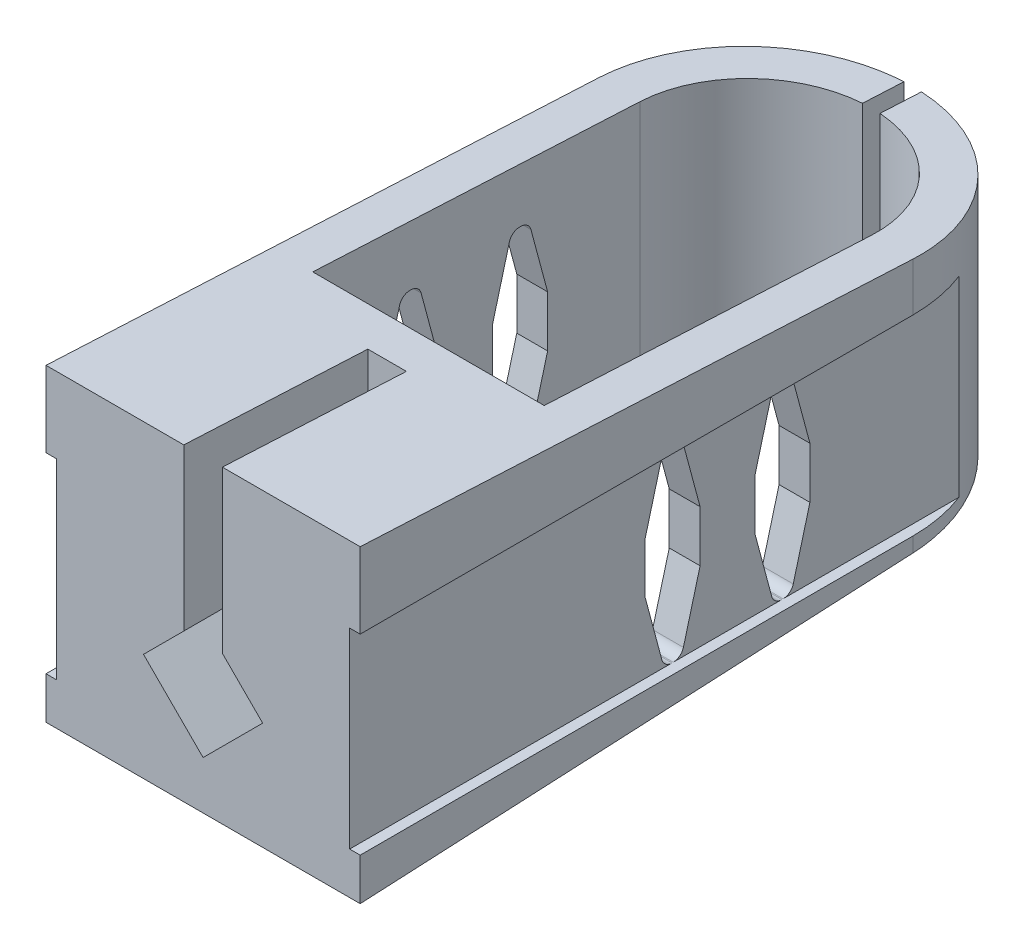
ISO-10303-21;
HEADER;
FILE_DESCRIPTION(('STEP AP214'),'2;1');
FILE_NAME('part.step','',(''),(''),'','','');
FILE_SCHEMA(('AUTOMOTIVE_DESIGN { 1 0 10303 214 1 1 1 1 }'));
ENDSEC;
DATA;
#1=APPLICATION_CONTEXT('core data for automotive mechanical design processes');
#2=APPLICATION_PROTOCOL_DEFINITION('international standard','automotive_design',2000,#1);
#3=PRODUCT_CONTEXT('',#1,'mechanical');
#4=PRODUCT('Part','Part','',(#3));
#5=PRODUCT_RELATED_PRODUCT_CATEGORY('part','',(#4));
#6=PRODUCT_DEFINITION_FORMATION('','',#4);
#7=PRODUCT_DEFINITION_CONTEXT('part definition',#1,'design');
#8=PRODUCT_DEFINITION('design','',#6,#7);
#9=PRODUCT_DEFINITION_SHAPE('','',#8);
#10=(LENGTH_UNIT() NAMED_UNIT(*) SI_UNIT(.MILLI.,.METRE.));
#11=(NAMED_UNIT(*) PLANE_ANGLE_UNIT() SI_UNIT($,.RADIAN.));
#12=(NAMED_UNIT(*) SI_UNIT($,.STERADIAN.) SOLID_ANGLE_UNIT());
#13=UNCERTAINTY_MEASURE_WITH_UNIT(LENGTH_MEASURE(1.E-05),#10,'distance_accuracy_value','');
#14=(GEOMETRIC_REPRESENTATION_CONTEXT(3) GLOBAL_UNCERTAINTY_ASSIGNED_CONTEXT((#13)) GLOBAL_UNIT_ASSIGNED_CONTEXT((#10,
#11,#12)) REPRESENTATION_CONTEXT('',''));
#15=CARTESIAN_POINT('',(0.,0.,0.));
#16=DIRECTION('',(0.,0.,1.));
#17=DIRECTION('',(1.,0.,0.));
#18=AXIS2_PLACEMENT_3D('',#15,#16,#17);
#19=CARTESIAN_POINT('',(0.,38.7,26.25));
#20=DIRECTION('',(-1.,0.,0.));
#21=DIRECTION('',(0.,0.,1.));
#22=AXIS2_PLACEMENT_3D('',#19,#20,#21);
#23=PLANE('',#22);
#24=DIRECTION('',(0.,1.,0.));
#25=VECTOR('',#24,1.);
#26=CARTESIAN_POINT('',(0.,38.7,26.25));
#27=LINE('',#26,#25);
#28=CARTESIAN_POINT('',(0.,33.3,26.25));
#29=VERTEX_POINT('',#28);
#30=CARTESIAN_POINT('',(0.,44.1,26.25));
#31=VERTEX_POINT('',#30);
#32=EDGE_CURVE('E1712',#29,#31,#27,.T.);
#33=ORIENTED_EDGE('',*,*,#32,.T.);
#34=DIRECTION('',(0.,-0.049322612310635,-0.998782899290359));
#35=VECTOR('',#34,1.);
#36=CARTESIAN_POINT('',(0.,41.6,-24.375));
#37=LINE('',#36,#35);
#38=CARTESIAN_POINT('',(0.,40.2065237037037,-52.592895));
#39=VERTEX_POINT('',#38);
#40=EDGE_CURVE('E1827',#31,#39,#37,.T.);
#41=ORIENTED_EDGE('',*,*,#40,.T.);
#42=DIRECTION('',(0.,1.,0.));
#43=VECTOR('',#42,1.);
#44=CARTESIAN_POINT('',(0.,-0.002000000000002,-52.592895));
#45=LINE('',#44,#43);
#46=CARTESIAN_POINT('',(0.,33.3,-52.592895));
#47=VERTEX_POINT('',#46);
#48=EDGE_CURVE('E1740',#47,#39,#45,.T.);
#49=ORIENTED_EDGE('',*,*,#48,.F.);
#50=DIRECTION('',(0.,0.,-1.));
#51=VECTOR('',#50,1.);
#52=CARTESIAN_POINT('',(0.,33.3,26.25));
#53=LINE('',#52,#51);
#54=EDGE_CURVE('E781',#29,#47,#53,.T.);
#55=ORIENTED_EDGE('',*,*,#54,.F.);
#56=EDGE_LOOP('',(#33,#41,#49,#55));
#57=FACE_BOUND('',#56,.T.);
#58=ADVANCED_FACE('F16',(#57),#23,.T.);
#59=CARTESIAN_POINT('',(44.81421,38.7,26.25));
#60=DIRECTION('',(-1.,0.,0.));
#61=DIRECTION('',(0.,0.,1.));
#62=AXIS2_PLACEMENT_3D('',#59,#60,#61);
#63=PLANE('',#62);
#64=DIRECTION('',(0.,-0.049322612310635,-0.998782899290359));
#65=VECTOR('',#64,1.);
#66=CARTESIAN_POINT('',(44.81421,41.6,-24.375));
#67=LINE('',#66,#65);
#68=CARTESIAN_POINT('',(44.81421,44.1,26.25));
#69=VERTEX_POINT('',#68);
#70=CARTESIAN_POINT('',(44.81421,40.2065237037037,-52.592895));
#71=VERTEX_POINT('',#70);
#72=EDGE_CURVE('E657',#69,#71,#67,.T.);
#73=ORIENTED_EDGE('',*,*,#72,.F.);
#74=DIRECTION('',(0.,1.,0.));
#75=VECTOR('',#74,1.);
#76=CARTESIAN_POINT('',(44.81421,38.7,26.25));
#77=LINE('',#76,#75);
#78=CARTESIAN_POINT('',(44.81421,33.3,26.25));
#79=VERTEX_POINT('',#78);
#80=EDGE_CURVE('E687',#79,#69,#77,.T.);
#81=ORIENTED_EDGE('',*,*,#80,.F.);
#82=DIRECTION('',(0.,0.,-1.));
#83=VECTOR('',#82,1.);
#84=CARTESIAN_POINT('',(44.81421,33.3,26.25));
#85=LINE('',#84,#83);
#86=CARTESIAN_POINT('',(44.81421,33.3,-52.592895));
#87=VERTEX_POINT('',#86);
#88=EDGE_CURVE('E753',#79,#87,#85,.T.);
#89=ORIENTED_EDGE('',*,*,#88,.T.);
#90=DIRECTION('',(0.,1.,0.));
#91=VECTOR('',#90,1.);
#92=CARTESIAN_POINT('',(44.81421,-0.002000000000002,-52.592895));
#93=LINE('',#92,#91);
#94=EDGE_CURVE('E1739',#87,#71,#93,.T.);
#95=ORIENTED_EDGE('',*,*,#94,.T.);
#96=EDGE_LOOP('',(#73,#81,#89,#95));
#97=FACE_BOUND('',#96,.T.);
#98=ADVANCED_FACE('F1621',(#97),#63,.F.);
#99=CARTESIAN_POINT('',(1.5,19.65,26.25));
#100=DIRECTION('',(1.,0.,0.));
#101=DIRECTION('',(0.,1.,0.));
#102=AXIS2_PLACEMENT_3D('',#99,#100,#101);
#103=PLANE('',#102);
#104=DIRECTION('',(0.,1.,0.));
#105=VECTOR('',#104,1.);
#106=CARTESIAN_POINT('',(1.5,19.65,-31.5666666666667));
#107=LINE('',#106,#105);
#108=CARTESIAN_POINT('',(1.5,16.,-31.5666666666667));
#109=VERTEX_POINT('',#108);
#110=CARTESIAN_POINT('',(1.5,23.3,-31.5666666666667));
#111=VERTEX_POINT('',#110);
#112=EDGE_CURVE('E1895',#109,#111,#107,.T.);
#113=ORIENTED_EDGE('',*,*,#112,.F.);
#114=DIRECTION('',(0.,0.965925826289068,0.258819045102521));
#115=VECTOR('',#114,1.);
#116=CARTESIAN_POINT('',(1.5,33.8596630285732,-26.7811843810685));
#117=LINE('',#116,#115);
#118=CARTESIAN_POINT('',(1.5,7.11177143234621,-33.9482603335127));
#119=VERTEX_POINT('',#118);
#120=EDGE_CURVE('E987',#109,#119,#117,.F.);
#121=ORIENTED_EDGE('',*,*,#120,.T.);
#122=CARTESIAN_POINT('',(1.5,7.5,-35.3971490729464));
#123=DIRECTION('',(1.,0.,0.));
#124=DIRECTION('',(0.,1.,0.));
#125=AXIS2_PLACEMENT_3D('',#122,#123,#124);
#126=CIRCLE('',#125,1.5);
#127=CARTESIAN_POINT('',(1.5,6.,-35.3971490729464));
#128=VERTEX_POINT('',#127);
#129=EDGE_CURVE('E1112',#119,#128,#126,.T.);
#130=ORIENTED_EDGE('',*,*,#129,.T.);
#131=DIRECTION('',(0.,0.,-1.));
#132=VECTOR('',#131,1.);
#133=CARTESIAN_POINT('',(1.5,6.,26.25));
#134=LINE('',#133,#132);
#135=CARTESIAN_POINT('',(1.5,6.,-19.9028509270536));
#136=VERTEX_POINT('',#135);
#137=EDGE_CURVE('E777',#136,#128,#134,.T.);
#138=ORIENTED_EDGE('',*,*,#137,.F.);
#139=CARTESIAN_POINT('',(1.5,7.5,-19.9028509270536));
#140=DIRECTION('',(1.,0.,0.));
#141=DIRECTION('',(0.,1.,0.));
#142=AXIS2_PLACEMENT_3D('',#139,#140,#141);
#143=CIRCLE('',#142,1.5);
#144=CARTESIAN_POINT('',(1.5,7.11177143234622,-21.3517396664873));
#145=VERTEX_POINT('',#144);
#146=EDGE_CURVE('E1194',#136,#145,#143,.T.);
#147=ORIENTED_EDGE('',*,*,#146,.T.);
#148=DIRECTION('',(0.,0.965925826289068,-0.258819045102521));
#149=VECTOR('',#148,1.);
#150=CARTESIAN_POINT('',(1.5,6.90966302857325,-21.2975848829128));
#151=LINE('',#150,#149);
#152=CARTESIAN_POINT('',(1.5,16.,-23.7333333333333));
#153=VERTEX_POINT('',#152);
#154=EDGE_CURVE('E869',#145,#153,#151,.T.);
#155=ORIENTED_EDGE('',*,*,#154,.T.);
#156=DIRECTION('',(0.,1.,0.));
#157=VECTOR('',#156,1.);
#158=CARTESIAN_POINT('',(1.5,19.65,-23.7333333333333));
#159=LINE('',#158,#157);
#160=CARTESIAN_POINT('',(1.5,23.3,-23.7333333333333));
#161=VERTEX_POINT('',#160);
#162=EDGE_CURVE('E1307',#153,#161,#159,.T.);
#163=ORIENTED_EDGE('',*,*,#162,.T.);
#164=DIRECTION('',(0.,-0.965925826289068,-0.258819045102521));
#165=VECTOR('',#164,1.);
#166=CARTESIAN_POINT('',(1.5,32.3903369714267,-21.2975848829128));
#167=LINE('',#166,#165);
#168=CARTESIAN_POINT('',(1.5,32.1882285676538,-21.3517396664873));
#169=VERTEX_POINT('',#168);
#170=EDGE_CURVE('E959',#161,#169,#167,.F.);
#171=ORIENTED_EDGE('',*,*,#170,.T.);
#172=CARTESIAN_POINT('',(1.5,31.8,-19.9028509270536));
#173=DIRECTION('',(1.,0.,0.));
#174=DIRECTION('',(0.,1.,0.));
#175=AXIS2_PLACEMENT_3D('',#172,#173,#174);
#176=CIRCLE('',#175,1.5);
#177=CARTESIAN_POINT('',(1.5,33.3,-19.9028509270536));
#178=VERTEX_POINT('',#177);
#179=EDGE_CURVE('E1125',#169,#178,#176,.T.);
#180=ORIENTED_EDGE('',*,*,#179,.T.);
#181=DIRECTION('',(0.,0.,-1.));
#182=VECTOR('',#181,1.);
#183=CARTESIAN_POINT('',(1.5,33.3,26.25));
#184=LINE('',#183,#182);
#185=CARTESIAN_POINT('',(1.5,33.3,-35.3971490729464));
#186=VERTEX_POINT('',#185);
#187=EDGE_CURVE('E782',#178,#186,#184,.T.);
#188=ORIENTED_EDGE('',*,*,#187,.T.);
#189=CARTESIAN_POINT('',(1.5,31.8,-35.3971490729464));
#190=DIRECTION('',(1.,0.,0.));
#191=DIRECTION('',(0.,1.,0.));
#192=AXIS2_PLACEMENT_3D('',#189,#190,#191);
#193=CIRCLE('',#192,1.5);
#194=CARTESIAN_POINT('',(1.5,32.1882285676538,-33.9482603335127));
#195=VERTEX_POINT('',#194);
#196=EDGE_CURVE('E1182',#186,#195,#193,.T.);
#197=ORIENTED_EDGE('',*,*,#196,.T.);
#198=DIRECTION('',(0.,-0.965925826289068,0.258819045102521));
#199=VECTOR('',#198,1.);
#200=CARTESIAN_POINT('',(1.5,5.44033697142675,-26.7811843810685));
#201=LINE('',#200,#199);
#202=EDGE_CURVE('E882',#195,#111,#201,.T.);
#203=ORIENTED_EDGE('',*,*,#202,.T.);
#204=EDGE_LOOP('',(#113,#121,#130,#138,#147,#155,#163,#171,#180,#188,#197,#203));
#205=FACE_BOUND('',#204,.T.);
#206=ADVANCED_FACE('F1611',(#205),#103,.F.);
#207=DIRECTION('',(0.,1.,0.));
#208=VECTOR('',#207,1.);
#209=CARTESIAN_POINT('',(1.5,19.65,-15.9));
#210=LINE('',#209,#208);
#211=CARTESIAN_POINT('',(1.5,16.,-15.9));
#212=VERTEX_POINT('',#211);
#213=CARTESIAN_POINT('',(1.5,23.3,-15.9));
#214=VERTEX_POINT('',#213);
#215=EDGE_CURVE('E1300',#212,#214,#210,.T.);
#216=ORIENTED_EDGE('',*,*,#215,.F.);
#217=DIRECTION('',(0.,0.965925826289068,0.258819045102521));
#218=VECTOR('',#217,1.);
#219=CARTESIAN_POINT('',(1.5,29.9429963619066,-12.163985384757));
#220=LINE('',#219,#218);
#221=CARTESIAN_POINT('',(1.5,7.11177143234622,-18.2815936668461));
#222=VERTEX_POINT('',#221);
#223=EDGE_CURVE('E980',#212,#222,#220,.F.);
#224=ORIENTED_EDGE('',*,*,#223,.T.);
#225=CARTESIAN_POINT('',(1.5,7.5,-19.7304824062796));
#226=DIRECTION('',(1.,0.,0.));
#227=DIRECTION('',(0.,1.,0.));
#228=AXIS2_PLACEMENT_3D('',#225,#226,#227);
#229=CIRCLE('',#228,1.5);
#230=CARTESIAN_POINT('',(1.5,6.,-19.7304824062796));
#231=VERTEX_POINT('',#230);
#232=EDGE_CURVE('E1105',#222,#231,#229,.T.);
#233=ORIENTED_EDGE('',*,*,#232,.T.);
#234=CARTESIAN_POINT('',(1.5,6.,26.25));
#235=VERTEX_POINT('',#234);
#236=EDGE_CURVE('E773',#235,#231,#134,.T.);
#237=ORIENTED_EDGE('',*,*,#236,.F.);
#238=DIRECTION('',(0.,-1.,0.));
#239=VECTOR('',#238,1.);
#240=CARTESIAN_POINT('',(1.5,19.65,26.25));
#241=LINE('',#240,#239);
#242=CARTESIAN_POINT('',(1.5,33.3,26.25));
#243=VERTEX_POINT('',#242);
#244=EDGE_CURVE('E670',#243,#235,#241,.T.);
#245=ORIENTED_EDGE('',*,*,#244,.F.);
#246=CARTESIAN_POINT('',(1.5,33.3,-19.7304824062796));
#247=VERTEX_POINT('',#246);
#248=EDGE_CURVE('E778',#243,#247,#184,.T.);
#249=ORIENTED_EDGE('',*,*,#248,.T.);
#250=CARTESIAN_POINT('',(1.5,31.8,-19.7304824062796));
#251=DIRECTION('',(1.,0.,0.));
#252=DIRECTION('',(0.,1.,0.));
#253=AXIS2_PLACEMENT_3D('',#250,#251,#252);
#254=CIRCLE('',#253,1.5);
#255=CARTESIAN_POINT('',(1.5,32.1882285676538,-18.2815936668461));
#256=VERTEX_POINT('',#255);
#257=EDGE_CURVE('E1188',#247,#256,#254,.T.);
#258=ORIENTED_EDGE('',*,*,#257,.T.);
#259=DIRECTION('',(0.,-0.965925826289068,0.258819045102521));
#260=VECTOR('',#259,1.);
#261=CARTESIAN_POINT('',(1.5,9.3570036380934,-12.163985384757));
#262=LINE('',#261,#260);
#263=EDGE_CURVE('E889',#256,#214,#262,.T.);
#264=ORIENTED_EDGE('',*,*,#263,.T.);
#265=EDGE_LOOP('',(#216,#224,#233,#237,#245,#249,#258,#264));
#266=FACE_BOUND('',#265,.T.);
#267=ADVANCED_FACE('F1607',(#266),#103,.F.);
#268=CARTESIAN_POINT('',(43.31421,19.65,26.25));
#269=DIRECTION('',(1.,0.,0.));
#270=DIRECTION('',(0.,1.,0.));
#271=AXIS2_PLACEMENT_3D('',#268,#269,#270);
#272=PLANE('',#271);
#273=DIRECTION('',(0.,0.,-1.));
#274=VECTOR('',#273,1.);
#275=CARTESIAN_POINT('',(43.31421,6.,26.25));
#276=LINE('',#275,#274);
#277=CARTESIAN_POINT('',(43.31421,6.,-19.9028509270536));
#278=VERTEX_POINT('',#277);
#279=CARTESIAN_POINT('',(43.31421,6.,-35.3971490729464));
#280=VERTEX_POINT('',#279);
#281=EDGE_CURVE('E766',#278,#280,#276,.T.);
#282=ORIENTED_EDGE('',*,*,#281,.T.);
#283=CARTESIAN_POINT('',(43.31421,7.5,-35.3971490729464));
#284=DIRECTION('',(1.,0.,0.));
#285=DIRECTION('',(0.,1.,0.));
#286=AXIS2_PLACEMENT_3D('',#283,#284,#285);
#287=CIRCLE('',#286,1.5);
#288=CARTESIAN_POINT('',(43.31421,7.11177143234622,-33.9482603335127));
#289=VERTEX_POINT('',#288);
#290=EDGE_CURVE('E1149',#280,#289,#287,.F.);
#291=ORIENTED_EDGE('',*,*,#290,.T.);
#292=DIRECTION('',(0.,0.965925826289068,0.258819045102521));
#293=VECTOR('',#292,1.);
#294=CARTESIAN_POINT('',(43.31421,6.,-34.2461585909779));
#295=LINE('',#294,#293);
#296=CARTESIAN_POINT('',(43.31421,16.,-31.5666666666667));
#297=VERTEX_POINT('',#296);
#298=EDGE_CURVE('E913',#289,#297,#295,.T.);
#299=ORIENTED_EDGE('',*,*,#298,.T.);
#300=DIRECTION('',(0.,1.,0.));
#301=VECTOR('',#300,1.);
#302=CARTESIAN_POINT('',(43.31421,19.65,-31.5666666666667));
#303=LINE('',#302,#301);
#304=CARTESIAN_POINT('',(43.31421,23.3,-31.5666666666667));
#305=VERTEX_POINT('',#304);
#306=EDGE_CURVE('E1891',#297,#305,#303,.T.);
#307=ORIENTED_EDGE('',*,*,#306,.T.);
#308=DIRECTION('',(0.,-0.965925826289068,0.258819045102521));
#309=VECTOR('',#308,1.);
#310=CARTESIAN_POINT('',(43.31421,23.3,-31.5666666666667));
#311=LINE('',#310,#309);
#312=CARTESIAN_POINT('',(43.31421,32.1882285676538,-33.9482603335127));
#313=VERTEX_POINT('',#312);
#314=EDGE_CURVE('E920',#305,#313,#311,.F.);
#315=ORIENTED_EDGE('',*,*,#314,.T.);
#316=CARTESIAN_POINT('',(43.31421,31.8,-35.3971490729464));
#317=DIRECTION('',(1.,0.,0.));
#318=DIRECTION('',(0.,1.,0.));
#319=AXIS2_PLACEMENT_3D('',#316,#317,#318);
#320=CIRCLE('',#319,1.5);
#321=CARTESIAN_POINT('',(43.31421,33.3,-35.3971490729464));
#322=VERTEX_POINT('',#321);
#323=EDGE_CURVE('E1172',#313,#322,#320,.F.);
#324=ORIENTED_EDGE('',*,*,#323,.T.);
#325=DIRECTION('',(0.,0.,-1.));
#326=VECTOR('',#325,1.);
#327=CARTESIAN_POINT('',(43.31421,33.3,26.25));
#328=LINE('',#327,#326);
#329=CARTESIAN_POINT('',(43.31421,33.3,-19.9028509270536));
#330=VERTEX_POINT('',#329);
#331=EDGE_CURVE('E761',#330,#322,#328,.T.);
#332=ORIENTED_EDGE('',*,*,#331,.F.);
#333=CARTESIAN_POINT('',(43.31421,31.8,-19.9028509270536));
#334=DIRECTION('',(1.,0.,0.));
#335=DIRECTION('',(0.,1.,0.));
#336=AXIS2_PLACEMENT_3D('',#333,#334,#335);
#337=CIRCLE('',#336,1.5);
#338=CARTESIAN_POINT('',(43.31421,32.1882285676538,-21.3517396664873));
#339=VERTEX_POINT('',#338);
#340=EDGE_CURVE('E1116',#330,#339,#337,.F.);
#341=ORIENTED_EDGE('',*,*,#340,.T.);
#342=DIRECTION('',(0.,-0.965925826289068,-0.258819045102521));
#343=VECTOR('',#342,1.);
#344=CARTESIAN_POINT('',(43.31421,33.3,-21.0538414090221));
#345=LINE('',#344,#343);
#346=CARTESIAN_POINT('',(43.31421,23.3,-23.7333333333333));
#347=VERTEX_POINT('',#346);
#348=EDGE_CURVE('E970',#339,#347,#345,.T.);
#349=ORIENTED_EDGE('',*,*,#348,.T.);
#350=DIRECTION('',(0.,1.,0.));
#351=VECTOR('',#350,1.);
#352=CARTESIAN_POINT('',(43.31421,19.65,-23.7333333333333));
#353=LINE('',#352,#351);
#354=CARTESIAN_POINT('',(43.31421,16.,-23.7333333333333));
#355=VERTEX_POINT('',#354);
#356=EDGE_CURVE('E1863',#355,#347,#353,.T.);
#357=ORIENTED_EDGE('',*,*,#356,.F.);
#358=DIRECTION('',(0.,0.965925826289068,-0.258819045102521));
#359=VECTOR('',#358,1.);
#360=CARTESIAN_POINT('',(43.31421,16.,-23.7333333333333));
#361=LINE('',#360,#359);
#362=CARTESIAN_POINT('',(43.31421,7.11177143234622,-21.3517396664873));
#363=VERTEX_POINT('',#362);
#364=EDGE_CURVE('E906',#355,#363,#361,.F.);
#365=ORIENTED_EDGE('',*,*,#364,.T.);
#366=CARTESIAN_POINT('',(43.31421,7.5,-19.9028509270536));
#367=DIRECTION('',(1.,0.,0.));
#368=DIRECTION('',(0.,1.,0.));
#369=AXIS2_PLACEMENT_3D('',#366,#367,#368);
#370=CIRCLE('',#369,1.5);
#371=EDGE_CURVE('E1145',#363,#278,#370,.F.);
#372=ORIENTED_EDGE('',*,*,#371,.T.);
#373=EDGE_LOOP('',(#282,#291,#299,#307,#315,#324,#332,#341,#349,#357,#365,#372));
#374=FACE_BOUND('',#373,.T.);
#375=ADVANCED_FACE('F1525',(#374),#272,.T.);
#376=CARTESIAN_POINT('',(43.31421,6.,26.25));
#377=VERTEX_POINT('',#376);
#378=CARTESIAN_POINT('',(43.31421,6.,-19.7304824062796));
#379=VERTEX_POINT('',#378);
#380=EDGE_CURVE('E762',#377,#379,#276,.T.);
#381=ORIENTED_EDGE('',*,*,#380,.T.);
#382=CARTESIAN_POINT('',(43.31421,7.5,-19.7304824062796));
#383=DIRECTION('',(1.,0.,0.));
#384=DIRECTION('',(0.,1.,0.));
#385=AXIS2_PLACEMENT_3D('',#382,#383,#384);
#386=CIRCLE('',#385,1.5);
#387=CARTESIAN_POINT('',(43.31421,7.11177143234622,-18.2815936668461));
#388=VERTEX_POINT('',#387);
#389=EDGE_CURVE('E1136',#379,#388,#386,.F.);
#390=ORIENTED_EDGE('',*,*,#389,.T.);
#391=DIRECTION('',(0.,0.965925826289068,0.258819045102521));
#392=VECTOR('',#391,1.);
#393=CARTESIAN_POINT('',(43.31421,6.,-18.5794919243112));
#394=LINE('',#393,#392);
#395=CARTESIAN_POINT('',(43.31421,16.,-15.9));
#396=VERTEX_POINT('',#395);
#397=EDGE_CURVE('E899',#388,#396,#394,.T.);
#398=ORIENTED_EDGE('',*,*,#397,.T.);
#399=DIRECTION('',(0.,1.,0.));
#400=VECTOR('',#399,1.);
#401=CARTESIAN_POINT('',(43.31421,19.65,-15.9));
#402=LINE('',#401,#400);
#403=CARTESIAN_POINT('',(43.31421,23.3,-15.9));
#404=VERTEX_POINT('',#403);
#405=EDGE_CURVE('E1872',#396,#404,#402,.T.);
#406=ORIENTED_EDGE('',*,*,#405,.T.);
#407=DIRECTION('',(0.,-0.965925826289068,0.258819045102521));
#408=VECTOR('',#407,1.);
#409=CARTESIAN_POINT('',(43.31421,23.3,-15.9));
#410=LINE('',#409,#408);
#411=CARTESIAN_POINT('',(43.31421,32.1882285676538,-18.2815936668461));
#412=VERTEX_POINT('',#411);
#413=EDGE_CURVE('E892',#404,#412,#410,.F.);
#414=ORIENTED_EDGE('',*,*,#413,.T.);
#415=CARTESIAN_POINT('',(43.31421,31.8,-19.7304824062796));
#416=DIRECTION('',(1.,0.,0.));
#417=DIRECTION('',(0.,1.,0.));
#418=AXIS2_PLACEMENT_3D('',#415,#416,#417);
#419=CIRCLE('',#418,1.5);
#420=CARTESIAN_POINT('',(43.31421,33.3,-19.7304824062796));
#421=VERTEX_POINT('',#420);
#422=EDGE_CURVE('E1165',#412,#421,#419,.F.);
#423=ORIENTED_EDGE('',*,*,#422,.T.);
#424=CARTESIAN_POINT('',(43.31421,33.3,26.25));
#425=VERTEX_POINT('',#424);
#426=EDGE_CURVE('E757',#425,#421,#328,.T.);
#427=ORIENTED_EDGE('',*,*,#426,.F.);
#428=DIRECTION('',(0.,-1.,0.));
#429=VECTOR('',#428,1.);
#430=CARTESIAN_POINT('',(43.31421,19.65,26.25));
#431=LINE('',#430,#429);
#432=EDGE_CURVE('E679',#425,#377,#431,.T.);
#433=ORIENTED_EDGE('',*,*,#432,.T.);
#434=EDGE_LOOP('',(#381,#390,#398,#406,#414,#423,#427,#433));
#435=FACE_BOUND('',#434,.T.);
#436=ADVANCED_FACE('F1520',(#435),#272,.T.);
#437=CARTESIAN_POINT('',(22.407105,-0.002000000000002,-52.592895));
#438=DIRECTION('',(0.,1.,0.));
#439=DIRECTION('',(0.,0.,1.));
#440=AXIS2_PLACEMENT_3D('',#437,#438,#439);
#441=CYLINDRICAL_SURFACE('',#440,22.407105);
#442=CARTESIAN_POINT('',(44.81421,3.8934762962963,-52.592895));
#443=VERTEX_POINT('',#442);
#444=CARTESIAN_POINT('',(44.81421,6.,-52.592895));
#445=VERTEX_POINT('',#444);
#446=EDGE_CURVE('E1747',#443,#445,#93,.T.);
#447=ORIENTED_EDGE('',*,*,#446,.F.);
#448=CARTESIAN_POINT('',(22.407105,3.8934762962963,-52.592895));
#449=DIRECTION('',(0.,-0.998782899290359,-0.0493226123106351));
#450=DIRECTION('',(0.,0.0493226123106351,-0.998782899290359));
#451=AXIS2_PLACEMENT_3D('',#448,#449,#450);
#452=ELLIPSE('',#451,22.4344099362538,22.407105);
#453=CARTESIAN_POINT('',(23.6571050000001,4.99827687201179,-74.9651066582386));
#454=VERTEX_POINT('',#453);
#455=EDGE_CURVE('E1752',#443,#454,#452,.F.);
#456=ORIENTED_EDGE('',*,*,#455,.T.);
#457=DIRECTION('',(0.,1.,0.));
#458=VECTOR('',#457,1.);
#459=CARTESIAN_POINT('',(23.6571050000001,-0.002000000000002,-74.9651066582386));
#460=LINE('',#459,#458);
#461=CARTESIAN_POINT('',(23.6571050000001,39.1017231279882,-74.9651066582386));
#462=VERTEX_POINT('',#461);
#463=EDGE_CURVE('E1757',#454,#462,#460,.T.);
#464=ORIENTED_EDGE('',*,*,#463,.T.);
#465=CARTESIAN_POINT('',(22.407105,40.2065237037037,-52.592895));
#466=DIRECTION('',(0.,-0.998782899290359,0.0493226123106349));
#467=DIRECTION('',(0.,0.049322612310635,0.998782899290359));
#468=AXIS2_PLACEMENT_3D('',#465,#466,#467);
#469=ELLIPSE('',#468,22.4344099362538,22.407105);
#470=EDGE_CURVE('E1851',#71,#462,#469,.F.);
#471=ORIENTED_EDGE('',*,*,#470,.F.);
#472=ORIENTED_EDGE('',*,*,#94,.F.);
#473=CARTESIAN_POINT('',(22.407105,33.3,-52.592895));
#474=DIRECTION('',(0.,-1.,0.));
#475=DIRECTION('',(0.,0.,-1.));
#476=AXIS2_PLACEMENT_3D('',#473,#474,#475);
#477=CIRCLE('',#476,22.407105);
#478=CARTESIAN_POINT('',(43.31421,33.3,-60.6533735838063));
#479=VERTEX_POINT('',#478);
#480=EDGE_CURVE('E1796',#479,#87,#477,.T.);
#481=ORIENTED_EDGE('',*,*,#480,.F.);
#482=DIRECTION('',(0.,1.,0.));
#483=VECTOR('',#482,1.);
#484=CARTESIAN_POINT('',(43.31421,-0.00199999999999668,-60.6533735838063));
#485=LINE('',#484,#483);
#486=CARTESIAN_POINT('',(43.31421,6.,-60.6533735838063));
#487=VERTEX_POINT('',#486);
#488=EDGE_CURVE('E1799',#487,#479,#485,.T.);
#489=ORIENTED_EDGE('',*,*,#488,.F.);
#490=CARTESIAN_POINT('',(22.407105,6.,-52.592895));
#491=DIRECTION('',(0.,-1.,0.));
#492=DIRECTION('',(0.,0.,-1.));
#493=AXIS2_PLACEMENT_3D('',#490,#491,#492);
#494=CIRCLE('',#493,22.407105);
#495=EDGE_CURVE('E717',#487,#445,#494,.T.);
#496=ORIENTED_EDGE('',*,*,#495,.T.);
#497=EDGE_LOOP('',(#447,#456,#464,#471,#472,#481,#489,#496));
#498=FACE_BOUND('',#497,.T.);
#499=ADVANCED_FACE('F1524',(#498),#441,.T.);
#500=CARTESIAN_POINT('',(22.407105,-0.002000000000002,-52.592895));
#501=DIRECTION('',(0.,1.,0.));
#502=DIRECTION('',(0.,0.,1.));
#503=AXIS2_PLACEMENT_3D('',#500,#501,#502);
#504=CYLINDRICAL_SURFACE('',#503,22.407105);
#505=DIRECTION('',(0.,1.,0.));
#506=VECTOR('',#505,1.);
#507=CARTESIAN_POINT('',(21.157105,-0.002000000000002,-74.9651066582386));
#508=LINE('',#507,#506);
#509=CARTESIAN_POINT('',(21.157105,4.99827687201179,-74.9651066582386));
#510=VERTEX_POINT('',#509);
#511=CARTESIAN_POINT('',(21.157105,39.1017231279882,-74.9651066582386));
#512=VERTEX_POINT('',#511);
#513=EDGE_CURVE('E1750',#510,#512,#508,.T.);
#514=ORIENTED_EDGE('',*,*,#513,.F.);
#515=CARTESIAN_POINT('',(22.407105,3.8934762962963,-52.592895));
#516=DIRECTION('',(0.,-0.998782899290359,-0.0493226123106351));
#517=DIRECTION('',(0.,0.0493226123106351,-0.998782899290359));
#518=AXIS2_PLACEMENT_3D('',#515,#516,#517);
#519=ELLIPSE('',#518,22.4344099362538,22.407105);
#520=CARTESIAN_POINT('',(0.,3.8934762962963,-52.592895));
#521=VERTEX_POINT('',#520);
#522=EDGE_CURVE('E1737',#510,#521,#519,.F.);
#523=ORIENTED_EDGE('',*,*,#522,.T.);
#524=CARTESIAN_POINT('',(0.,6.,-52.592895));
#525=VERTEX_POINT('',#524);
#526=EDGE_CURVE('E655',#521,#525,#45,.T.);
#527=ORIENTED_EDGE('',*,*,#526,.T.);
#528=CARTESIAN_POINT('',(22.407105,6.,-52.592895));
#529=DIRECTION('',(0.,1.,0.));
#530=DIRECTION('',(0.,0.,1.));
#531=AXIS2_PLACEMENT_3D('',#528,#529,#530);
#532=CIRCLE('',#531,22.407105);
#533=CARTESIAN_POINT('',(1.5,6.,-60.6533735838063));
#534=VERTEX_POINT('',#533);
#535=EDGE_CURVE('E1731',#534,#525,#532,.T.);
#536=ORIENTED_EDGE('',*,*,#535,.F.);
#537=DIRECTION('',(0.,1.,0.));
#538=VECTOR('',#537,1.);
#539=CARTESIAN_POINT('',(1.5,-0.00200000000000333,-60.6533735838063));
#540=LINE('',#539,#538);
#541=CARTESIAN_POINT('',(1.5,33.3,-60.6533735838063));
#542=VERTEX_POINT('',#541);
#543=EDGE_CURVE('E1790',#534,#542,#540,.T.);
#544=ORIENTED_EDGE('',*,*,#543,.T.);
#545=CARTESIAN_POINT('',(22.407105,33.3,-52.592895));
#546=DIRECTION('',(0.,1.,0.));
#547=DIRECTION('',(0.,0.,1.));
#548=AXIS2_PLACEMENT_3D('',#545,#546,#547);
#549=CIRCLE('',#548,22.407105);
#550=EDGE_CURVE('E1792',#542,#47,#549,.T.);
#551=ORIENTED_EDGE('',*,*,#550,.T.);
#552=ORIENTED_EDGE('',*,*,#48,.T.);
#553=CARTESIAN_POINT('',(22.407105,40.2065237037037,-52.592895));
#554=DIRECTION('',(0.,-0.998782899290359,0.0493226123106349));
#555=DIRECTION('',(0.,0.049322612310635,0.998782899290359));
#556=AXIS2_PLACEMENT_3D('',#553,#554,#555);
#557=ELLIPSE('',#556,22.4344099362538,22.407105);
#558=EDGE_CURVE('E1844',#512,#39,#557,.F.);
#559=ORIENTED_EDGE('',*,*,#558,.F.);
#560=EDGE_LOOP('',(#514,#523,#527,#536,#544,#551,#552,#559));
#561=FACE_BOUND('',#560,.T.);
#562=ADVANCED_FACE('F1734',(#561),#504,.T.);
#563=CARTESIAN_POINT('',(22.407105,-0.002000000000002,-52.592895));
#564=DIRECTION('',(0.,1.,0.));
#565=DIRECTION('',(0.,0.,1.));
#566=AXIS2_PLACEMENT_3D('',#563,#564,#565);
#567=CYLINDRICAL_SURFACE('',#566,16.507105);
#568=CARTESIAN_POINT('',(22.407105,3.8934762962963,-52.592895));
#569=DIRECTION('',(0.,-0.998782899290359,-0.0493226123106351));
#570=DIRECTION('',(0.,0.0493226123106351,-0.998782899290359));
#571=AXIS2_PLACEMENT_3D('',#568,#569,#570);
#572=ELLIPSE('',#571,16.5272202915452,16.507105);
#573=CARTESIAN_POINT('',(38.91421,3.8934762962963,-52.592895));
#574=VERTEX_POINT('',#573);
#575=CARTESIAN_POINT('',(23.6571050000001,4.70630142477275,-69.0526038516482));
#576=VERTEX_POINT('',#575);
#577=EDGE_CURVE('E1914',#574,#576,#572,.F.);
#578=ORIENTED_EDGE('',*,*,#577,.F.);
#579=DIRECTION('',(0.,1.,0.));
#580=VECTOR('',#579,1.);
#581=CARTESIAN_POINT('',(38.91421,-0.002000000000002,-52.592895));
#582=LINE('',#581,#580);
#583=CARTESIAN_POINT('',(38.91421,40.2065237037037,-52.592895));
#584=VERTEX_POINT('',#583);
#585=EDGE_CURVE('E1769',#574,#584,#582,.T.);
#586=ORIENTED_EDGE('',*,*,#585,.T.);
#587=CARTESIAN_POINT('',(22.407105,40.2065237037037,-52.592895));
#588=DIRECTION('',(0.,-0.998782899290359,0.0493226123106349));
#589=DIRECTION('',(0.,0.049322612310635,0.998782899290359));
#590=AXIS2_PLACEMENT_3D('',#587,#588,#589);
#591=ELLIPSE('',#590,16.5272202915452,16.507105);
#592=CARTESIAN_POINT('',(23.6571050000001,39.3936985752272,-69.0526038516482));
#593=VERTEX_POINT('',#592);
#594=EDGE_CURVE('E1840',#584,#593,#591,.F.);
#595=ORIENTED_EDGE('',*,*,#594,.T.);
#596=DIRECTION('',(0.,1.,0.));
#597=VECTOR('',#596,1.);
#598=CARTESIAN_POINT('',(23.6571050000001,-0.002000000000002,-69.0526038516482));
#599=LINE('',#598,#597);
#600=EDGE_CURVE('E1761',#576,#593,#599,.T.);
#601=ORIENTED_EDGE('',*,*,#600,.F.);
#602=EDGE_LOOP('',(#578,#586,#595,#601));
#603=FACE_BOUND('',#602,.T.);
#604=ADVANCED_FACE('F1932',(#603),#567,.F.);
#605=CARTESIAN_POINT('',(23.6571050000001,-0.002000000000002,-72.0088552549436));
#606=DIRECTION('',(1.,0.,0.));
#607=DIRECTION('',(0.,0.,-1.));
#608=AXIS2_PLACEMENT_3D('',#605,#606,#607);
#609=PLANE('',#608);
#610=DIRECTION('',(0.,0.0493226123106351,-0.998782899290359));
#611=VECTOR('',#610,1.);
#612=CARTESIAN_POINT('',(23.6571050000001,4.84048002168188,-71.769720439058));
#613=LINE('',#612,#611);
#614=EDGE_CURVE('E1918',#576,#454,#613,.T.);
#615=ORIENTED_EDGE('',*,*,#614,.F.);
#616=ORIENTED_EDGE('',*,*,#600,.T.);
#617=DIRECTION('',(0.,-0.049322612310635,-0.998782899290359));
#618=VECTOR('',#617,1.);
#619=CARTESIAN_POINT('',(23.6571050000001,39.1522272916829,-73.9423973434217));
#620=LINE('',#619,#618);
#621=EDGE_CURVE('E1847',#593,#462,#620,.T.);
#622=ORIENTED_EDGE('',*,*,#621,.T.);
#623=ORIENTED_EDGE('',*,*,#463,.F.);
#624=EDGE_LOOP('',(#615,#616,#622,#623));
#625=FACE_BOUND('',#624,.T.);
#626=ADVANCED_FACE('F1927',(#625),#609,.F.);
#627=CARTESIAN_POINT('',(21.157105,-0.002000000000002,-72.0088552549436));
#628=DIRECTION('',(1.,0.,0.));
#629=DIRECTION('',(0.,0.,-1.));
#630=AXIS2_PLACEMENT_3D('',#627,#628,#629);
#631=PLANE('',#630);
#632=DIRECTION('',(0.,1.,0.));
#633=VECTOR('',#632,1.);
#634=CARTESIAN_POINT('',(21.157105,-0.002000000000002,-69.0526038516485));
#635=LINE('',#634,#633);
#636=CARTESIAN_POINT('',(21.157105,4.70630142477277,-69.0526038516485));
#637=VERTEX_POINT('',#636);
#638=CARTESIAN_POINT('',(21.157105,39.3936985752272,-69.0526038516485));
#639=VERTEX_POINT('',#638);
#640=EDGE_CURVE('E1765',#637,#639,#635,.T.);
#641=ORIENTED_EDGE('',*,*,#640,.F.);
#642=DIRECTION('',(0.,0.0493226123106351,-0.998782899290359));
#643=VECTOR('',#642,1.);
#644=CARTESIAN_POINT('',(21.157105,4.84048002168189,-71.7697204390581));
#645=LINE('',#644,#643);
#646=EDGE_CURVE('E1910',#637,#510,#645,.T.);
#647=ORIENTED_EDGE('',*,*,#646,.T.);
#648=ORIENTED_EDGE('',*,*,#513,.T.);
#649=DIRECTION('',(0.,-0.049322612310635,-0.998782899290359));
#650=VECTOR('',#649,1.);
#651=CARTESIAN_POINT('',(21.157105,39.1522272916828,-73.9423973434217));
#652=LINE('',#651,#650);
#653=EDGE_CURVE('E1837',#639,#512,#652,.T.);
#654=ORIENTED_EDGE('',*,*,#653,.F.);
#655=EDGE_LOOP('',(#641,#647,#648,#654));
#656=FACE_BOUND('',#655,.T.);
#657=ADVANCED_FACE('F1948',(#656),#631,.T.);
#658=CARTESIAN_POINT('',(22.407105,-0.002000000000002,-52.592895));
#659=DIRECTION('',(0.,1.,0.));
#660=DIRECTION('',(0.,0.,1.));
#661=AXIS2_PLACEMENT_3D('',#658,#659,#660);
#662=CYLINDRICAL_SURFACE('',#661,16.507105);
#663=CARTESIAN_POINT('',(22.407105,3.8934762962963,-52.592895));
#664=DIRECTION('',(0.,-0.998782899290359,-0.0493226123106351));
#665=DIRECTION('',(0.,0.0493226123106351,-0.998782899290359));
#666=AXIS2_PLACEMENT_3D('',#663,#664,#665);
#667=ELLIPSE('',#666,16.5272202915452,16.507105);
#668=CARTESIAN_POINT('',(5.9,3.8934762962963,-52.592895));
#669=VERTEX_POINT('',#668);
#670=EDGE_CURVE('E1907',#637,#669,#667,.F.);
#671=ORIENTED_EDGE('',*,*,#670,.F.);
#672=ORIENTED_EDGE('',*,*,#640,.T.);
#673=CARTESIAN_POINT('',(22.407105,40.2065237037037,-52.592895));
#674=DIRECTION('',(0.,-0.998782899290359,0.0493226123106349));
#675=DIRECTION('',(0.,0.049322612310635,0.998782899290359));
#676=AXIS2_PLACEMENT_3D('',#673,#674,#675);
#677=ELLIPSE('',#676,16.5272202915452,16.507105);
#678=CARTESIAN_POINT('',(5.9,40.2065237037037,-52.592895));
#679=VERTEX_POINT('',#678);
#680=EDGE_CURVE('E1833',#639,#679,#677,.F.);
#681=ORIENTED_EDGE('',*,*,#680,.T.);
#682=DIRECTION('',(0.,1.,0.));
#683=VECTOR('',#682,1.);
#684=CARTESIAN_POINT('',(5.9,-0.002000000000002,-52.592895));
#685=LINE('',#684,#683);
#686=EDGE_CURVE('E1781',#669,#679,#685,.T.);
#687=ORIENTED_EDGE('',*,*,#686,.F.);
#688=EDGE_LOOP('',(#671,#672,#681,#687));
#689=FACE_BOUND('',#688,.T.);
#690=ADVANCED_FACE('F1596',(#689),#662,.F.);
#691=CARTESIAN_POINT('',(5.9,-0.002000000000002,-29.2464475));
#692=DIRECTION('',(1.,0.,0.));
#693=DIRECTION('',(0.,0.,-1.));
#694=AXIS2_PLACEMENT_3D('',#691,#692,#693);
#695=PLANE('',#694);
#696=DIRECTION('',(0.,0.,-1.));
#697=VECTOR('',#696,1.);
#698=CARTESIAN_POINT('',(5.9,6.,-29.2464475));
#699=LINE('',#698,#697);
#700=CARTESIAN_POINT('',(5.9,6.,-19.7304824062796));
#701=VERTEX_POINT('',#700);
#702=CARTESIAN_POINT('',(5.9,6.,-19.9028509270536));
#703=VERTEX_POINT('',#702);
#704=EDGE_CURVE('E1302',#701,#703,#699,.T.);
#705=ORIENTED_EDGE('',*,*,#704,.F.);
#706=CARTESIAN_POINT('',(5.9,7.5,-19.7304824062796));
#707=DIRECTION('',(1.,0.,0.));
#708=DIRECTION('',(0.,0.,-1.));
#709=AXIS2_PLACEMENT_3D('',#706,#707,#708);
#710=CIRCLE('',#709,1.5);
#711=CARTESIAN_POINT('',(5.9,7.11177143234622,-18.2815936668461));
#712=VERTEX_POINT('',#711);
#713=EDGE_CURVE('E1102',#701,#712,#710,.F.);
#714=ORIENTED_EDGE('',*,*,#713,.T.);
#715=DIRECTION('',(0.,-0.965925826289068,-0.258819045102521));
#716=VECTOR('',#715,1.);
#717=CARTESIAN_POINT('',(5.9,6.,-18.5794919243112));
#718=LINE('',#717,#716);
#719=CARTESIAN_POINT('',(5.9,16.,-15.9));
#720=VERTEX_POINT('',#719);
#721=EDGE_CURVE('E977',#712,#720,#718,.F.);
#722=ORIENTED_EDGE('',*,*,#721,.T.);
#723=DIRECTION('',(0.,1.,0.));
#724=VECTOR('',#723,1.);
#725=CARTESIAN_POINT('',(5.9,-0.002000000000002,-15.9));
#726=LINE('',#725,#724);
#727=CARTESIAN_POINT('',(5.9,23.3,-15.9));
#728=VERTEX_POINT('',#727);
#729=EDGE_CURVE('E1306',#720,#728,#726,.T.);
#730=ORIENTED_EDGE('',*,*,#729,.T.);
#731=DIRECTION('',(0.,0.965925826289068,-0.258819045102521));
#732=VECTOR('',#731,1.);
#733=CARTESIAN_POINT('',(5.9,23.3,-15.9));
#734=LINE('',#733,#732);
#735=CARTESIAN_POINT('',(5.9,32.1882285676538,-18.2815936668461));
#736=VERTEX_POINT('',#735);
#737=EDGE_CURVE('E885',#728,#736,#734,.T.);
#738=ORIENTED_EDGE('',*,*,#737,.T.);
#739=CARTESIAN_POINT('',(5.9,31.8,-19.7304824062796));
#740=DIRECTION('',(1.,0.,0.));
#741=DIRECTION('',(0.,0.,-1.));
#742=AXIS2_PLACEMENT_3D('',#739,#740,#741);
#743=CIRCLE('',#742,1.5);
#744=CARTESIAN_POINT('',(5.9,33.3,-19.7304824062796));
#745=VERTEX_POINT('',#744);
#746=EDGE_CURVE('E1191',#736,#745,#743,.F.);
#747=ORIENTED_EDGE('',*,*,#746,.T.);
#748=DIRECTION('',(0.,0.,-1.));
#749=VECTOR('',#748,1.);
#750=CARTESIAN_POINT('',(5.9,33.3,-29.2464475));
#751=LINE('',#750,#749);
#752=CARTESIAN_POINT('',(5.9,33.3,-19.9028509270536));
#753=VERTEX_POINT('',#752);
#754=EDGE_CURVE('E1288',#745,#753,#751,.T.);
#755=ORIENTED_EDGE('',*,*,#754,.T.);
#756=CARTESIAN_POINT('',(5.9,31.8,-19.9028509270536));
#757=DIRECTION('',(1.,0.,0.));
#758=DIRECTION('',(0.,0.,-1.));
#759=AXIS2_PLACEMENT_3D('',#756,#757,#758);
#760=CIRCLE('',#759,1.5);
#761=CARTESIAN_POINT('',(5.9,32.1882285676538,-21.3517396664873));
#762=VERTEX_POINT('',#761);
#763=EDGE_CURVE('E1122',#753,#762,#760,.F.);
#764=ORIENTED_EDGE('',*,*,#763,.T.);
#765=DIRECTION('',(0.,0.965925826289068,0.258819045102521));
#766=VECTOR('',#765,1.);
#767=CARTESIAN_POINT('',(5.9,33.3,-21.0538414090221));
#768=LINE('',#767,#766);
#769=CARTESIAN_POINT('',(5.9,23.3,-23.7333333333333));
#770=VERTEX_POINT('',#769);
#771=EDGE_CURVE('E956',#762,#770,#768,.F.);
#772=ORIENTED_EDGE('',*,*,#771,.T.);
#773=DIRECTION('',(0.,1.,0.));
#774=VECTOR('',#773,1.);
#775=CARTESIAN_POINT('',(5.9,-0.0020000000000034,-23.7333333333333));
#776=LINE('',#775,#774);
#777=CARTESIAN_POINT('',(5.9,16.,-23.7333333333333));
#778=VERTEX_POINT('',#777);
#779=EDGE_CURVE('E1292',#778,#770,#776,.T.);
#780=ORIENTED_EDGE('',*,*,#779,.F.);
#781=DIRECTION('',(0.,-0.965925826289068,0.258819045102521));
#782=VECTOR('',#781,1.);
#783=CARTESIAN_POINT('',(5.9,16.,-23.7333333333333));
#784=LINE('',#783,#782);
#785=CARTESIAN_POINT('',(5.9,7.11177143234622,-21.3517396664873));
#786=VERTEX_POINT('',#785);
#787=EDGE_CURVE('E865',#778,#786,#784,.T.);
#788=ORIENTED_EDGE('',*,*,#787,.T.);
#789=CARTESIAN_POINT('',(5.9,7.5,-19.9028509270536));
#790=DIRECTION('',(1.,0.,0.));
#791=DIRECTION('',(0.,0.,-1.));
#792=AXIS2_PLACEMENT_3D('',#789,#790,#791);
#793=CIRCLE('',#792,1.5);
#794=EDGE_CURVE('E1197',#786,#703,#793,.F.);
#795=ORIENTED_EDGE('',*,*,#794,.T.);
#796=EDGE_LOOP('',(#705,#714,#722,#730,#738,#747,#755,#764,#772,#780,#788,#795));
#797=FACE_BOUND('',#796,.T.);
#798=DIRECTION('',(0.,0.,-1.));
#799=VECTOR('',#798,1.);
#800=CARTESIAN_POINT('',(5.9,6.,-29.2464475));
#801=LINE('',#800,#799);
#802=CARTESIAN_POINT('',(5.9,6.,-35.3971490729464));
#803=VERTEX_POINT('',#802);
#804=CARTESIAN_POINT('',(5.9,6.,-35.5695175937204));
#805=VERTEX_POINT('',#804);
#806=EDGE_CURVE('E1309',#803,#805,#801,.T.);
#807=ORIENTED_EDGE('',*,*,#806,.F.);
#808=CARTESIAN_POINT('',(5.9,7.5,-35.3971490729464));
#809=DIRECTION('',(1.,0.,0.));
#810=DIRECTION('',(0.,0.,-1.));
#811=AXIS2_PLACEMENT_3D('',#808,#809,#810);
#812=CIRCLE('',#811,1.5);
#813=CARTESIAN_POINT('',(5.9,7.11177143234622,-33.9482603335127));
#814=VERTEX_POINT('',#813);
#815=EDGE_CURVE('E1109',#803,#814,#812,.F.);
#816=ORIENTED_EDGE('',*,*,#815,.T.);
#817=DIRECTION('',(0.,-0.965925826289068,-0.258819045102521));
#818=VECTOR('',#817,1.);
#819=CARTESIAN_POINT('',(5.9,6.,-34.2461585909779));
#820=LINE('',#819,#818);
#821=CARTESIAN_POINT('',(5.9,16.,-31.5666666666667));
#822=VERTEX_POINT('',#821);
#823=EDGE_CURVE('E984',#814,#822,#820,.F.);
#824=ORIENTED_EDGE('',*,*,#823,.T.);
#825=DIRECTION('',(0.,1.,0.));
#826=VECTOR('',#825,1.);
#827=CARTESIAN_POINT('',(5.9,-0.002000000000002,-31.5666666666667));
#828=LINE('',#827,#826);
#829=CARTESIAN_POINT('',(5.9,23.3,-31.5666666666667));
#830=VERTEX_POINT('',#829);
#831=EDGE_CURVE('E1312',#822,#830,#828,.T.);
#832=ORIENTED_EDGE('',*,*,#831,.T.);
#833=DIRECTION('',(0.,0.965925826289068,-0.258819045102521));
#834=VECTOR('',#833,1.);
#835=CARTESIAN_POINT('',(5.9,23.3,-31.5666666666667));
#836=LINE('',#835,#834);
#837=CARTESIAN_POINT('',(5.9,32.1882285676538,-33.9482603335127));
#838=VERTEX_POINT('',#837);
#839=EDGE_CURVE('E878',#830,#838,#836,.T.);
#840=ORIENTED_EDGE('',*,*,#839,.T.);
#841=CARTESIAN_POINT('',(5.9,31.8,-35.3971490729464));
#842=DIRECTION('',(1.,0.,0.));
#843=DIRECTION('',(0.,0.,-1.));
#844=AXIS2_PLACEMENT_3D('',#841,#842,#843);
#845=CIRCLE('',#844,1.5);
#846=CARTESIAN_POINT('',(5.9,33.3,-35.3971490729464));
#847=VERTEX_POINT('',#846);
#848=EDGE_CURVE('E1185',#838,#847,#845,.F.);
#849=ORIENTED_EDGE('',*,*,#848,.T.);
#850=DIRECTION('',(0.,0.,-1.));
#851=VECTOR('',#850,1.);
#852=CARTESIAN_POINT('',(5.9,33.3,-29.2464475));
#853=LINE('',#852,#851);
#854=CARTESIAN_POINT('',(5.9,33.3,-35.5695175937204));
#855=VERTEX_POINT('',#854);
#856=EDGE_CURVE('E1295',#847,#855,#853,.T.);
#857=ORIENTED_EDGE('',*,*,#856,.T.);
#858=CARTESIAN_POINT('',(5.9,31.8,-35.5695175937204));
#859=DIRECTION('',(1.,0.,0.));
#860=DIRECTION('',(0.,0.,-1.));
#861=AXIS2_PLACEMENT_3D('',#858,#859,#860);
#862=CIRCLE('',#861,1.5);
#863=CARTESIAN_POINT('',(5.9,32.1882285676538,-37.018406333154));
#864=VERTEX_POINT('',#863);
#865=EDGE_CURVE('E1129',#855,#864,#862,.F.);
#866=ORIENTED_EDGE('',*,*,#865,.T.);
#867=DIRECTION('',(0.,0.965925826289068,0.258819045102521));
#868=VECTOR('',#867,1.);
#869=CARTESIAN_POINT('',(5.9,33.3,-36.7205080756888));
#870=LINE('',#869,#868);
#871=CARTESIAN_POINT('',(5.9,23.3,-39.4));
#872=VERTEX_POINT('',#871);
#873=EDGE_CURVE('E963',#864,#872,#870,.F.);
#874=ORIENTED_EDGE('',*,*,#873,.T.);
#875=DIRECTION('',(0.,1.,0.));
#876=VECTOR('',#875,1.);
#877=CARTESIAN_POINT('',(5.9,-0.002000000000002,-39.4));
#878=LINE('',#877,#876);
#879=CARTESIAN_POINT('',(5.9,16.,-39.4));
#880=VERTEX_POINT('',#879);
#881=EDGE_CURVE('E1299',#880,#872,#878,.T.);
#882=ORIENTED_EDGE('',*,*,#881,.F.);
#883=DIRECTION('',(0.,-0.965925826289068,0.258819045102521));
#884=VECTOR('',#883,1.);
#885=CARTESIAN_POINT('',(5.9,16.,-39.4));
#886=LINE('',#885,#884);
#887=CARTESIAN_POINT('',(5.9,7.11177143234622,-37.018406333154));
#888=VERTEX_POINT('',#887);
#889=EDGE_CURVE('E872',#880,#888,#886,.T.);
#890=ORIENTED_EDGE('',*,*,#889,.T.);
#891=CARTESIAN_POINT('',(5.9,7.5,-35.5695175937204));
#892=DIRECTION('',(1.,0.,0.));
#893=DIRECTION('',(0.,0.,-1.));
#894=AXIS2_PLACEMENT_3D('',#891,#892,#893);
#895=CIRCLE('',#894,1.5);
#896=EDGE_CURVE('E10',#888,#805,#895,.F.);
#897=ORIENTED_EDGE('',*,*,#896,.T.);
#898=EDGE_LOOP('',(#807,#816,#824,#832,#840,#849,#857,#866,#874,#882,#890,#897));
#899=FACE_BOUND('',#898,.T.);
#900=DIRECTION('',(0.,1.,0.));
#901=VECTOR('',#900,1.);
#902=CARTESIAN_POINT('',(5.9,-0.002000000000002,-5.9));
#903=LINE('',#902,#901);
#904=CARTESIAN_POINT('',(5.9,1.58765432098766,-5.9));
#905=VERTEX_POINT('',#904);
#906=CARTESIAN_POINT('',(5.9,42.5123456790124,-5.9));
#907=VERTEX_POINT('',#906);
#908=EDGE_CURVE('E1777',#905,#907,#903,.T.);
#909=ORIENTED_EDGE('',*,*,#908,.F.);
#910=DIRECTION('',(0.,0.0493226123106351,-0.998782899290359));
#911=VECTOR('',#910,1.);
#912=CARTESIAN_POINT('',(5.9,2.73389341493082,-29.1113416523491));
#913=LINE('',#912,#911);
#914=EDGE_CURVE('E1903',#905,#669,#913,.T.);
#915=ORIENTED_EDGE('',*,*,#914,.T.);
#916=ORIENTED_EDGE('',*,*,#686,.T.);
#917=DIRECTION('',(0.,-0.049322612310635,-0.998782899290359));
#918=VECTOR('',#917,1.);
#919=CARTESIAN_POINT('',(5.9,41.2588138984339,-31.2840185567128));
#920=LINE('',#919,#918);
#921=EDGE_CURVE('E1822',#907,#679,#920,.T.);
#922=ORIENTED_EDGE('',*,*,#921,.F.);
#923=EDGE_LOOP('',(#909,#915,#916,#922));
#924=FACE_BOUND('',#923,.T.);
#925=ADVANCED_FACE('F1591',(#797,#899,#924),#695,.T.);
#926=CARTESIAN_POINT('',(22.407105,-0.002000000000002,-5.9));
#927=DIRECTION('',(0.,0.,-1.));
#928=DIRECTION('',(-1.,0.,0.));
#929=AXIS2_PLACEMENT_3D('',#926,#927,#928);
#930=PLANE('',#929);
#931=DIRECTION('',(0.,1.,0.));
#932=VECTOR('',#931,1.);
#933=CARTESIAN_POINT('',(38.91421,-0.002000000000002,-5.9));
#934=LINE('',#933,#932);
#935=CARTESIAN_POINT('',(38.91421,1.58765432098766,-5.9));
#936=VERTEX_POINT('',#935);
#937=CARTESIAN_POINT('',(38.91421,42.5123456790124,-5.9));
#938=VERTEX_POINT('',#937);
#939=EDGE_CURVE('E1773',#936,#938,#934,.T.);
#940=ORIENTED_EDGE('',*,*,#939,.F.);
#941=DIRECTION('',(-1.,0.,0.));
#942=VECTOR('',#941,1.);
#943=CARTESIAN_POINT('',(22.407105,1.58765432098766,-5.9));
#944=LINE('',#943,#942);
#945=EDGE_CURVE('E1899',#936,#905,#944,.T.);
#946=ORIENTED_EDGE('',*,*,#945,.T.);
#947=ORIENTED_EDGE('',*,*,#908,.T.);
#948=DIRECTION('',(-1.,0.,0.));
#949=VECTOR('',#948,1.);
#950=CARTESIAN_POINT('',(22.407105,42.5123456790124,-5.9));
#951=LINE('',#950,#949);
#952=EDGE_CURVE('E1818',#938,#907,#951,.T.);
#953=ORIENTED_EDGE('',*,*,#952,.F.);
#954=EDGE_LOOP('',(#940,#946,#947,#953));
#955=FACE_BOUND('',#954,.T.);
#956=ADVANCED_FACE('F1595',(#955),#930,.T.);
#957=CARTESIAN_POINT('',(38.91421,-0.002000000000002,-29.2464475));
#958=DIRECTION('',(1.,0.,0.));
#959=DIRECTION('',(0.,0.,-1.));
#960=AXIS2_PLACEMENT_3D('',#957,#958,#959);
#961=PLANE('',#960);
#962=DIRECTION('',(0.,1.,0.));
#963=VECTOR('',#962,1.);
#964=CARTESIAN_POINT('',(38.91421,-0.002000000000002,-31.5666666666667));
#965=LINE('',#964,#963);
#966=CARTESIAN_POINT('',(38.91421,16.,-31.5666666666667));
#967=VERTEX_POINT('',#966);
#968=CARTESIAN_POINT('',(38.91421,23.3,-31.5666666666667));
#969=VERTEX_POINT('',#968);
#970=EDGE_CURVE('E817',#967,#969,#965,.T.);
#971=ORIENTED_EDGE('',*,*,#970,.F.);
#972=DIRECTION('',(0.,-0.965925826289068,-0.258819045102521));
#973=VECTOR('',#972,1.);
#974=CARTESIAN_POINT('',(38.91421,1.64998553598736,-35.4117414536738));
#975=LINE('',#974,#973);
#976=CARTESIAN_POINT('',(38.91421,7.11177143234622,-33.9482603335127));
#977=VERTEX_POINT('',#976);
#978=EDGE_CURVE('E916',#967,#977,#975,.T.);
#979=ORIENTED_EDGE('',*,*,#978,.T.);
#980=CARTESIAN_POINT('',(38.91421,7.5,-35.3971490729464));
#981=DIRECTION('',(1.,0.,0.));
#982=DIRECTION('',(0.,0.,-1.));
#983=AXIS2_PLACEMENT_3D('',#980,#981,#982);
#984=CIRCLE('',#983,1.5);
#985=CARTESIAN_POINT('',(38.91421,6.,-35.3971490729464));
#986=VERTEX_POINT('',#985);
#987=EDGE_CURVE('E1152',#977,#986,#984,.T.);
#988=ORIENTED_EDGE('',*,*,#987,.T.);
#989=DIRECTION('',(0.,0.,-1.));
#990=VECTOR('',#989,1.);
#991=CARTESIAN_POINT('',(38.91421,6.,-29.2464475));
#992=LINE('',#991,#990);
#993=CARTESIAN_POINT('',(38.91421,6.,-35.5695175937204));
#994=VERTEX_POINT('',#993);
#995=EDGE_CURVE('E813',#986,#994,#992,.T.);
#996=ORIENTED_EDGE('',*,*,#995,.T.);
#997=CARTESIAN_POINT('',(38.91421,7.5,-35.5695175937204));
#998=DIRECTION('',(1.,0.,0.));
#999=DIRECTION('',(0.,0.,-1.));
#1000=AXIS2_PLACEMENT_3D('',#997,#998,#999);
#1001=CIRCLE('',#1000,1.5);
#1002=CARTESIAN_POINT('',(38.91421,7.11177143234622,-37.018406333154));
#1003=VERTEX_POINT('',#1002);
#1004=EDGE_CURVE('E1155',#994,#1003,#1001,.T.);
#1005=ORIENTED_EDGE('',*,*,#1004,.T.);
#1006=DIRECTION('',(0.,-0.965925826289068,0.258819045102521));
#1007=VECTOR('',#1006,1.);
#1008=CARTESIAN_POINT('',(38.91421,-1.46845738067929,-34.7193409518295));
#1009=LINE('',#1008,#1007);
#1010=CARTESIAN_POINT('',(38.91421,16.,-39.4));
#1011=VERTEX_POINT('',#1010);
#1012=EDGE_CURVE('E938',#1003,#1011,#1009,.F.);
#1013=ORIENTED_EDGE('',*,*,#1012,.T.);
#1014=DIRECTION('',(0.,1.,0.));
#1015=VECTOR('',#1014,1.);
#1016=CARTESIAN_POINT('',(38.91421,-0.002000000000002,-39.4));
#1017=LINE('',#1016,#1015);
#1018=CARTESIAN_POINT('',(38.91421,23.3,-39.4));
#1019=VERTEX_POINT('',#1018);
#1020=EDGE_CURVE('E809',#1011,#1019,#1017,.T.);
#1021=ORIENTED_EDGE('',*,*,#1020,.T.);
#1022=DIRECTION('',(0.,0.965925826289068,0.258819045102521));
#1023=VECTOR('',#1022,1.);
#1024=CARTESIAN_POINT('',(38.91421,4.09732614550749,-44.5453409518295));
#1025=LINE('',#1024,#1023);
#1026=CARTESIAN_POINT('',(38.91421,32.1882285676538,-37.018406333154));
#1027=VERTEX_POINT('',#1026);
#1028=EDGE_CURVE('E930',#1019,#1027,#1025,.T.);
#1029=ORIENTED_EDGE('',*,*,#1028,.T.);
#1030=CARTESIAN_POINT('',(38.91421,31.8,-35.5695175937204));
#1031=DIRECTION('',(1.,0.,0.));
#1032=DIRECTION('',(0.,0.,-1.));
#1033=AXIS2_PLACEMENT_3D('',#1030,#1031,#1032);
#1034=CIRCLE('',#1033,1.5);
#1035=CARTESIAN_POINT('',(38.91421,33.3,-35.5695175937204));
#1036=VERTEX_POINT('',#1035);
#1037=EDGE_CURVE('E1179',#1027,#1036,#1034,.T.);
#1038=ORIENTED_EDGE('',*,*,#1037,.T.);
#1039=DIRECTION('',(0.,0.,-1.));
#1040=VECTOR('',#1039,1.);
#1041=CARTESIAN_POINT('',(38.91421,33.3,-29.2464475));
#1042=LINE('',#1041,#1040);
#1043=CARTESIAN_POINT('',(38.91421,33.3,-35.3971490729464));
#1044=VERTEX_POINT('',#1043);
#1045=EDGE_CURVE('E805',#1044,#1036,#1042,.T.);
#1046=ORIENTED_EDGE('',*,*,#1045,.F.);
#1047=CARTESIAN_POINT('',(38.91421,31.8,-35.3971490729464));
#1048=DIRECTION('',(1.,0.,0.));
#1049=DIRECTION('',(0.,0.,-1.));
#1050=AXIS2_PLACEMENT_3D('',#1047,#1048,#1049);
#1051=CIRCLE('',#1050,1.5);
#1052=CARTESIAN_POINT('',(38.91421,32.1882285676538,-33.9482603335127));
#1053=VERTEX_POINT('',#1052);
#1054=EDGE_CURVE('E1169',#1044,#1053,#1051,.T.);
#1055=ORIENTED_EDGE('',*,*,#1054,.T.);
#1056=DIRECTION('',(0.,0.965925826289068,-0.258819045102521));
#1057=VECTOR('',#1056,1.);
#1058=CARTESIAN_POINT('',(38.91421,0.978883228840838,-25.5857414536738));
#1059=LINE('',#1058,#1057);
#1060=EDGE_CURVE('E924',#1053,#969,#1059,.F.);
#1061=ORIENTED_EDGE('',*,*,#1060,.T.);
#1062=EDGE_LOOP('',(#971,#979,#988,#996,#1005,#1013,#1021,#1029,#1038,#1046,#1055,#1061));
#1063=FACE_BOUND('',#1062,.T.);
#1064=DIRECTION('',(0.,1.,0.));
#1065=VECTOR('',#1064,1.);
#1066=CARTESIAN_POINT('',(38.91421,-0.002000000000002,-15.9));
#1067=LINE('',#1066,#1065);
#1068=CARTESIAN_POINT('',(38.91421,16.,-15.9));
#1069=VERTEX_POINT('',#1068);
#1070=CARTESIAN_POINT('',(38.91421,23.3,-15.9));
#1071=VERTEX_POINT('',#1070);
#1072=EDGE_CURVE('E801',#1069,#1071,#1067,.T.);
#1073=ORIENTED_EDGE('',*,*,#1072,.F.);
#1074=DIRECTION('',(0.,-0.965925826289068,-0.258819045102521));
#1075=VECTOR('',#1074,1.);
#1076=CARTESIAN_POINT('',(38.91421,-2.2666811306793,-20.7945424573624));
#1077=LINE('',#1076,#1075);
#1078=CARTESIAN_POINT('',(38.91421,7.11177143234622,-18.2815936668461));
#1079=VERTEX_POINT('',#1078);
#1080=EDGE_CURVE('E902',#1069,#1079,#1077,.T.);
#1081=ORIENTED_EDGE('',*,*,#1080,.T.);
#1082=CARTESIAN_POINT('',(38.91421,7.5,-19.7304824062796));
#1083=DIRECTION('',(1.,0.,0.));
#1084=DIRECTION('',(0.,0.,-1.));
#1085=AXIS2_PLACEMENT_3D('',#1082,#1083,#1084);
#1086=CIRCLE('',#1085,1.5);
#1087=CARTESIAN_POINT('',(38.91421,6.,-19.7304824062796));
#1088=VERTEX_POINT('',#1087);
#1089=EDGE_CURVE('E1139',#1079,#1088,#1086,.T.);
#1090=ORIENTED_EDGE('',*,*,#1089,.T.);
#1091=DIRECTION('',(0.,0.,-1.));
#1092=VECTOR('',#1091,1.);
#1093=CARTESIAN_POINT('',(38.91421,6.,-29.2464475));
#1094=LINE('',#1093,#1092);
#1095=CARTESIAN_POINT('',(38.91421,6.,-19.9028509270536));
#1096=VERTEX_POINT('',#1095);
#1097=EDGE_CURVE('E797',#1088,#1096,#1094,.T.);
#1098=ORIENTED_EDGE('',*,*,#1097,.T.);
#1099=CARTESIAN_POINT('',(38.91421,7.5,-19.9028509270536));
#1100=DIRECTION('',(1.,0.,0.));
#1101=DIRECTION('',(0.,0.,-1.));
#1102=AXIS2_PLACEMENT_3D('',#1099,#1100,#1101);
#1103=CIRCLE('',#1102,1.5);
#1104=CARTESIAN_POINT('',(38.91421,7.11177143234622,-21.3517396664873));
#1105=VERTEX_POINT('',#1104);
#1106=EDGE_CURVE('E1142',#1096,#1105,#1103,.T.);
#1107=ORIENTED_EDGE('',*,*,#1106,.T.);
#1108=DIRECTION('',(0.,-0.965925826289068,0.258819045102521));
#1109=VECTOR('',#1108,1.);
#1110=CARTESIAN_POINT('',(38.91421,2.44820928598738,-20.1021419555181));
#1111=LINE('',#1110,#1109);
#1112=CARTESIAN_POINT('',(38.91421,16.,-23.7333333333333));
#1113=VERTEX_POINT('',#1112);
#1114=EDGE_CURVE('E910',#1105,#1113,#1111,.F.);
#1115=ORIENTED_EDGE('',*,*,#1114,.T.);
#1116=DIRECTION('',(0.,1.,0.));
#1117=VECTOR('',#1116,1.);
#1118=CARTESIAN_POINT('',(38.91421,-0.0020000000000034,-23.7333333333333));
#1119=LINE('',#1118,#1117);
#1120=CARTESIAN_POINT('',(38.91421,23.3,-23.7333333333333));
#1121=VERTEX_POINT('',#1120);
#1122=EDGE_CURVE('E793',#1113,#1121,#1119,.T.);
#1123=ORIENTED_EDGE('',*,*,#1122,.T.);
#1124=DIRECTION('',(0.,0.965925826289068,0.258819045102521));
#1125=VECTOR('',#1124,1.);
#1126=CARTESIAN_POINT('',(38.91421,0.180659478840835,-29.928141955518));
#1127=LINE('',#1126,#1125);
#1128=CARTESIAN_POINT('',(38.91421,32.1882285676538,-21.3517396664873));
#1129=VERTEX_POINT('',#1128);
#1130=EDGE_CURVE('E973',#1121,#1129,#1127,.T.);
#1131=ORIENTED_EDGE('',*,*,#1130,.T.);
#1132=CARTESIAN_POINT('',(38.91421,31.8,-19.9028509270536));
#1133=DIRECTION('',(1.,0.,0.));
#1134=DIRECTION('',(0.,0.,-1.));
#1135=AXIS2_PLACEMENT_3D('',#1132,#1133,#1134);
#1136=CIRCLE('',#1135,1.5);
#1137=CARTESIAN_POINT('',(38.91421,33.3,-19.9028509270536));
#1138=VERTEX_POINT('',#1137);
#1139=EDGE_CURVE('E1119',#1129,#1138,#1136,.T.);
#1140=ORIENTED_EDGE('',*,*,#1139,.T.);
#1141=DIRECTION('',(0.,0.,-1.));
#1142=VECTOR('',#1141,1.);
#1143=CARTESIAN_POINT('',(38.91421,33.3,-29.2464475));
#1144=LINE('',#1143,#1142);
#1145=CARTESIAN_POINT('',(38.91421,33.3,-19.7304824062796));
#1146=VERTEX_POINT('',#1145);
#1147=EDGE_CURVE('E789',#1146,#1138,#1144,.T.);
#1148=ORIENTED_EDGE('',*,*,#1147,.F.);
#1149=CARTESIAN_POINT('',(38.91421,31.8,-19.7304824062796));
#1150=DIRECTION('',(1.,0.,0.));
#1151=DIRECTION('',(0.,0.,-1.));
#1152=AXIS2_PLACEMENT_3D('',#1149,#1150,#1151);
#1153=CIRCLE('',#1152,1.5);
#1154=CARTESIAN_POINT('',(38.91421,32.1882285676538,-18.2815936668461));
#1155=VERTEX_POINT('',#1154);
#1156=EDGE_CURVE('E1162',#1146,#1155,#1153,.T.);
#1157=ORIENTED_EDGE('',*,*,#1156,.T.);
#1158=DIRECTION('',(0.,0.965925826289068,-0.258819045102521));
#1159=VECTOR('',#1158,1.);
#1160=CARTESIAN_POINT('',(38.91421,4.89554989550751,-10.9685424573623));
#1161=LINE('',#1160,#1159);
#1162=EDGE_CURVE('E896',#1155,#1071,#1161,.F.);
#1163=ORIENTED_EDGE('',*,*,#1162,.T.);
#1164=EDGE_LOOP('',(#1073,#1081,#1090,#1098,#1107,#1115,#1123,#1131,#1140,#1148,#1157,#1163));
#1165=FACE_BOUND('',#1164,.T.);
#1166=DIRECTION('',(0.,0.0493226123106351,-0.998782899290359));
#1167=VECTOR('',#1166,1.);
#1168=CARTESIAN_POINT('',(38.91421,2.73389341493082,-29.1113416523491));
#1169=LINE('',#1168,#1167);
#1170=EDGE_CURVE('E821',#936,#574,#1169,.T.);
#1171=ORIENTED_EDGE('',*,*,#1170,.F.);
#1172=ORIENTED_EDGE('',*,*,#939,.T.);
#1173=DIRECTION('',(0.,-0.049322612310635,-0.998782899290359));
#1174=VECTOR('',#1173,1.);
#1175=CARTESIAN_POINT('',(38.91421,41.2588138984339,-31.2840185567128));
#1176=LINE('',#1175,#1174);
#1177=EDGE_CURVE('E785',#938,#584,#1176,.T.);
#1178=ORIENTED_EDGE('',*,*,#1177,.T.);
#1179=ORIENTED_EDGE('',*,*,#585,.F.);
#1180=EDGE_LOOP('',(#1171,#1172,#1178,#1179));
#1181=FACE_BOUND('',#1180,.T.);
#1182=ADVANCED_FACE('F1573',(#1063,#1165,#1181),#961,.F.);
#1183=CARTESIAN_POINT('',(0.75,33.3,26.25));
#1184=DIRECTION('',(0.,1.,0.));
#1185=DIRECTION('',(0.,0.,1.));
#1186=AXIS2_PLACEMENT_3D('',#1183,#1184,#1185);
#1187=PLANE('',#1186);
#1188=ORIENTED_EDGE('',*,*,#187,.F.);
#1189=DIRECTION('',(-1.,0.,0.));
#1190=VECTOR('',#1189,1.);
#1191=CARTESIAN_POINT('',(5.9,33.3,-19.9028509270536));
#1192=LINE('',#1191,#1190);
#1193=EDGE_CURVE('E1044',#178,#753,#1192,.F.);
#1194=ORIENTED_EDGE('',*,*,#1193,.T.);
#1195=ORIENTED_EDGE('',*,*,#754,.F.);
#1196=DIRECTION('',(-1.,0.,0.));
#1197=VECTOR('',#1196,1.);
#1198=CARTESIAN_POINT('',(1.5,33.3,-19.7304824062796));
#1199=LINE('',#1198,#1197);
#1200=EDGE_CURVE('E1032',#745,#247,#1199,.T.);
#1201=ORIENTED_EDGE('',*,*,#1200,.T.);
#1202=ORIENTED_EDGE('',*,*,#248,.F.);
#1203=DIRECTION('',(1.,0.,0.));
#1204=VECTOR('',#1203,1.);
#1205=CARTESIAN_POINT('',(0.75,33.3,26.25));
#1206=LINE('',#1205,#1204);
#1207=EDGE_CURVE('E1718',#29,#243,#1206,.T.);
#1208=ORIENTED_EDGE('',*,*,#1207,.F.);
#1209=ORIENTED_EDGE('',*,*,#54,.T.);
#1210=ORIENTED_EDGE('',*,*,#550,.F.);
#1211=CARTESIAN_POINT('',(1.5,33.3,-35.5695175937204));
#1212=VERTEX_POINT('',#1211);
#1213=EDGE_CURVE('E776',#1212,#542,#184,.T.);
#1214=ORIENTED_EDGE('',*,*,#1213,.F.);
#1215=DIRECTION('',(-1.,0.,0.));
#1216=VECTOR('',#1215,1.);
#1217=CARTESIAN_POINT('',(5.9,33.3,-35.5695175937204));
#1218=LINE('',#1217,#1216);
#1219=EDGE_CURVE('E1040',#1212,#855,#1218,.F.);
#1220=ORIENTED_EDGE('',*,*,#1219,.T.);
#1221=ORIENTED_EDGE('',*,*,#856,.F.);
#1222=DIRECTION('',(-1.,0.,0.));
#1223=VECTOR('',#1222,1.);
#1224=CARTESIAN_POINT('',(1.5,33.3,-35.3971490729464));
#1225=LINE('',#1224,#1223);
#1226=EDGE_CURVE('E1036',#847,#186,#1225,.T.);
#1227=ORIENTED_EDGE('',*,*,#1226,.T.);
#1228=EDGE_LOOP('',(#1188,#1194,#1195,#1201,#1202,#1208,#1209,#1210,#1214,#1220,#1221,#1227));
#1229=FACE_BOUND('',#1228,.T.);
#1230=ADVANCED_FACE('F1568',(#1229),#1187,.F.);
#1231=CARTESIAN_POINT('',(1.5,6.,-35.5695175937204));
#1232=VERTEX_POINT('',#1231);
#1233=EDGE_CURVE('E772',#1232,#534,#134,.T.);
#1234=ORIENTED_EDGE('',*,*,#1233,.F.);
#1235=CARTESIAN_POINT('',(1.5,7.5,-35.5695175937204));
#1236=DIRECTION('',(1.,0.,0.));
#1237=DIRECTION('',(0.,1.,0.));
#1238=AXIS2_PLACEMENT_3D('',#1235,#1236,#1237);
#1239=CIRCLE('',#1238,1.5);
#1240=CARTESIAN_POINT('',(1.5,7.11177143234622,-37.018406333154));
#1241=VERTEX_POINT('',#1240);
#1242=EDGE_CURVE('E25',#1232,#1241,#1239,.T.);
#1243=ORIENTED_EDGE('',*,*,#1242,.T.);
#1244=DIRECTION('',(0.,0.965925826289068,-0.258819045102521));
#1245=VECTOR('',#1244,1.);
#1246=CARTESIAN_POINT('',(1.5,2.99299636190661,-35.9147838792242));
#1247=LINE('',#1246,#1245);
#1248=CARTESIAN_POINT('',(1.5,16.,-39.4));
#1249=VERTEX_POINT('',#1248);
#1250=EDGE_CURVE('E875',#1241,#1249,#1247,.T.);
#1251=ORIENTED_EDGE('',*,*,#1250,.T.);
#1252=DIRECTION('',(0.,1.,0.));
#1253=VECTOR('',#1252,1.);
#1254=CARTESIAN_POINT('',(1.5,19.65,-39.4));
#1255=LINE('',#1254,#1253);
#1256=CARTESIAN_POINT('',(1.5,23.3,-39.4));
#1257=VERTEX_POINT('',#1256);
#1258=EDGE_CURVE('E1313',#1249,#1257,#1255,.T.);
#1259=ORIENTED_EDGE('',*,*,#1258,.T.);
#1260=DIRECTION('',(0.,-0.965925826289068,-0.258819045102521));
#1261=VECTOR('',#1260,1.);
#1262=CARTESIAN_POINT('',(1.5,36.3070036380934,-35.9147838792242));
#1263=LINE('',#1262,#1261);
#1264=CARTESIAN_POINT('',(1.5,32.1882285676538,-37.018406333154));
#1265=VERTEX_POINT('',#1264);
#1266=EDGE_CURVE('E966',#1257,#1265,#1263,.F.);
#1267=ORIENTED_EDGE('',*,*,#1266,.T.);
#1268=CARTESIAN_POINT('',(1.5,31.8,-35.5695175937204));
#1269=DIRECTION('',(1.,0.,0.));
#1270=DIRECTION('',(0.,1.,0.));
#1271=AXIS2_PLACEMENT_3D('',#1268,#1269,#1270);
#1272=CIRCLE('',#1271,1.5);
#1273=EDGE_CURVE('E1132',#1265,#1212,#1272,.T.);
#1274=ORIENTED_EDGE('',*,*,#1273,.T.);
#1275=ORIENTED_EDGE('',*,*,#1213,.T.);
#1276=ORIENTED_EDGE('',*,*,#543,.F.);
#1277=EDGE_LOOP('',(#1234,#1243,#1251,#1259,#1267,#1274,#1275,#1276));
#1278=FACE_BOUND('',#1277,.T.);
#1279=ADVANCED_FACE('F1572',(#1278),#103,.F.);
#1280=CARTESIAN_POINT('',(0.75,6.,26.25));
#1281=DIRECTION('',(0.,1.,0.));
#1282=DIRECTION('',(0.,0.,1.));
#1283=AXIS2_PLACEMENT_3D('',#1280,#1281,#1282);
#1284=PLANE('',#1283);
#1285=ORIENTED_EDGE('',*,*,#236,.T.);
#1286=DIRECTION('',(-1.,0.,0.));
#1287=VECTOR('',#1286,1.);
#1288=CARTESIAN_POINT('',(0.75,6.,-19.7304824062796));
#1289=LINE('',#1288,#1287);
#1290=EDGE_CURVE('E1003',#231,#701,#1289,.F.);
#1291=ORIENTED_EDGE('',*,*,#1290,.T.);
#1292=ORIENTED_EDGE('',*,*,#704,.T.);
#1293=DIRECTION('',(-1.,0.,0.));
#1294=VECTOR('',#1293,1.);
#1295=CARTESIAN_POINT('',(0.75,6.,-19.9028509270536));
#1296=LINE('',#1295,#1294);
#1297=EDGE_CURVE('E995',#703,#136,#1296,.T.);
#1298=ORIENTED_EDGE('',*,*,#1297,.T.);
#1299=ORIENTED_EDGE('',*,*,#137,.T.);
#1300=DIRECTION('',(-1.,0.,0.));
#1301=VECTOR('',#1300,1.);
#1302=CARTESIAN_POINT('',(0.75,6.,-35.3971490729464));
#1303=LINE('',#1302,#1301);
#1304=EDGE_CURVE('E999',#128,#803,#1303,.F.);
#1305=ORIENTED_EDGE('',*,*,#1304,.T.);
#1306=ORIENTED_EDGE('',*,*,#806,.T.);
#1307=DIRECTION('',(-1.,0.,0.));
#1308=VECTOR('',#1307,1.);
#1309=CARTESIAN_POINT('',(0.75,6.,-35.5695175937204));
#1310=LINE('',#1309,#1308);
#1311=EDGE_CURVE('E991',#805,#1232,#1310,.T.);
#1312=ORIENTED_EDGE('',*,*,#1311,.T.);
#1313=ORIENTED_EDGE('',*,*,#1233,.T.);
#1314=ORIENTED_EDGE('',*,*,#535,.T.);
#1315=DIRECTION('',(0.,0.,-1.));
#1316=VECTOR('',#1315,1.);
#1317=CARTESIAN_POINT('',(0.,6.,26.25));
#1318=LINE('',#1317,#1316);
#1319=CARTESIAN_POINT('',(0.,6.,26.25));
#1320=VERTEX_POINT('',#1319);
#1321=EDGE_CURVE('E769',#1320,#525,#1318,.T.);
#1322=ORIENTED_EDGE('',*,*,#1321,.F.);
#1323=DIRECTION('',(1.,0.,0.));
#1324=VECTOR('',#1323,1.);
#1325=CARTESIAN_POINT('',(0.75,6.,26.25));
#1326=LINE('',#1325,#1324);
#1327=EDGE_CURVE('E663',#1320,#235,#1326,.T.);
#1328=ORIENTED_EDGE('',*,*,#1327,.T.);
#1329=EDGE_LOOP('',(#1285,#1291,#1292,#1298,#1299,#1305,#1306,#1312,#1313,#1314,#1322,#1328));
#1330=FACE_BOUND('',#1329,.T.);
#1331=ADVANCED_FACE('F1514',(#1330),#1284,.T.);
#1332=CARTESIAN_POINT('',(44.06421,6.,26.25));
#1333=DIRECTION('',(0.,-1.,0.));
#1334=DIRECTION('',(0.,0.,-1.));
#1335=AXIS2_PLACEMENT_3D('',#1332,#1333,#1334);
#1336=PLANE('',#1335);
#1337=ORIENTED_EDGE('',*,*,#1097,.F.);
#1338=DIRECTION('',(1.,0.,0.));
#1339=VECTOR('',#1338,1.);
#1340=CARTESIAN_POINT('',(43.31421,6.,-19.7304824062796));
#1341=LINE('',#1340,#1339);
#1342=EDGE_CURVE('E1066',#1088,#379,#1341,.T.);
#1343=ORIENTED_EDGE('',*,*,#1342,.T.);
#1344=ORIENTED_EDGE('',*,*,#380,.F.);
#1345=DIRECTION('',(-1.,0.,0.));
#1346=VECTOR('',#1345,1.);
#1347=CARTESIAN_POINT('',(44.06421,6.,26.25));
#1348=LINE('',#1347,#1346);
#1349=CARTESIAN_POINT('',(44.81421,6.,26.25));
#1350=VERTEX_POINT('',#1349);
#1351=EDGE_CURVE('E676',#1350,#377,#1348,.T.);
#1352=ORIENTED_EDGE('',*,*,#1351,.F.);
#1353=DIRECTION('',(0.,0.,-1.));
#1354=VECTOR('',#1353,1.);
#1355=CARTESIAN_POINT('',(44.81421,6.,26.25));
#1356=LINE('',#1355,#1354);
#1357=EDGE_CURVE('E765',#1350,#445,#1356,.T.);
#1358=ORIENTED_EDGE('',*,*,#1357,.T.);
#1359=ORIENTED_EDGE('',*,*,#495,.F.);
#1360=CARTESIAN_POINT('',(43.31421,6.,-35.5695175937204));
#1361=VERTEX_POINT('',#1360);
#1362=EDGE_CURVE('E760',#1361,#487,#276,.T.);
#1363=ORIENTED_EDGE('',*,*,#1362,.F.);
#1364=DIRECTION('',(1.,0.,0.));
#1365=VECTOR('',#1364,1.);
#1366=CARTESIAN_POINT('',(38.91421,6.,-35.5695175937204));
#1367=LINE('',#1366,#1365);
#1368=EDGE_CURVE('E1054',#1361,#994,#1367,.F.);
#1369=ORIENTED_EDGE('',*,*,#1368,.T.);
#1370=ORIENTED_EDGE('',*,*,#995,.F.);
#1371=DIRECTION('',(1.,0.,0.));
#1372=VECTOR('',#1371,1.);
#1373=CARTESIAN_POINT('',(43.31421,6.,-35.3971490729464));
#1374=LINE('',#1373,#1372);
#1375=EDGE_CURVE('E1058',#986,#280,#1374,.T.);
#1376=ORIENTED_EDGE('',*,*,#1375,.T.);
#1377=ORIENTED_EDGE('',*,*,#281,.F.);
#1378=DIRECTION('',(1.,0.,0.));
#1379=VECTOR('',#1378,1.);
#1380=CARTESIAN_POINT('',(38.91421,6.,-19.9028509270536));
#1381=LINE('',#1380,#1379);
#1382=EDGE_CURVE('E1062',#278,#1096,#1381,.F.);
#1383=ORIENTED_EDGE('',*,*,#1382,.T.);
#1384=EDGE_LOOP('',(#1337,#1343,#1344,#1352,#1358,#1359,#1363,#1369,#1370,#1376,#1377,#1383));
#1385=FACE_BOUND('',#1384,.T.);
#1386=ADVANCED_FACE('F1509',(#1385),#1336,.F.);
#1387=DIRECTION('',(0.,1.,0.));
#1388=VECTOR('',#1387,1.);
#1389=CARTESIAN_POINT('',(43.31421,19.65,-39.4));
#1390=LINE('',#1389,#1388);
#1391=CARTESIAN_POINT('',(43.31421,16.,-39.4));
#1392=VERTEX_POINT('',#1391);
#1393=CARTESIAN_POINT('',(43.31421,23.3,-39.4));
#1394=VERTEX_POINT('',#1393);
#1395=EDGE_CURVE('E1882',#1392,#1394,#1390,.T.);
#1396=ORIENTED_EDGE('',*,*,#1395,.F.);
#1397=DIRECTION('',(0.,0.965925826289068,-0.258819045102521));
#1398=VECTOR('',#1397,1.);
#1399=CARTESIAN_POINT('',(43.31421,16.,-39.4));
#1400=LINE('',#1399,#1398);
#1401=CARTESIAN_POINT('',(43.31421,7.11177143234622,-37.018406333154));
#1402=VERTEX_POINT('',#1401);
#1403=EDGE_CURVE('E934',#1392,#1402,#1400,.F.);
#1404=ORIENTED_EDGE('',*,*,#1403,.T.);
#1405=CARTESIAN_POINT('',(43.31421,7.5,-35.5695175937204));
#1406=DIRECTION('',(1.,0.,0.));
#1407=DIRECTION('',(0.,1.,0.));
#1408=AXIS2_PLACEMENT_3D('',#1405,#1406,#1407);
#1409=CIRCLE('',#1408,1.5);
#1410=EDGE_CURVE('E1158',#1402,#1361,#1409,.F.);
#1411=ORIENTED_EDGE('',*,*,#1410,.T.);
#1412=ORIENTED_EDGE('',*,*,#1362,.T.);
#1413=ORIENTED_EDGE('',*,*,#488,.T.);
#1414=CARTESIAN_POINT('',(43.31421,33.3,-35.5695175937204));
#1415=VERTEX_POINT('',#1414);
#1416=EDGE_CURVE('E756',#1415,#479,#328,.T.);
#1417=ORIENTED_EDGE('',*,*,#1416,.F.);
#1418=CARTESIAN_POINT('',(43.31421,31.8,-35.5695175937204));
#1419=DIRECTION('',(1.,0.,0.));
#1420=DIRECTION('',(0.,1.,0.));
#1421=AXIS2_PLACEMENT_3D('',#1418,#1419,#1420);
#1422=CIRCLE('',#1421,1.5);
#1423=CARTESIAN_POINT('',(43.31421,32.1882285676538,-37.018406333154));
#1424=VERTEX_POINT('',#1423);
#1425=EDGE_CURVE('E1176',#1415,#1424,#1422,.F.);
#1426=ORIENTED_EDGE('',*,*,#1425,.T.);
#1427=DIRECTION('',(0.,-0.965925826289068,-0.258819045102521));
#1428=VECTOR('',#1427,1.);
#1429=CARTESIAN_POINT('',(43.31421,33.3,-36.7205080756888));
#1430=LINE('',#1429,#1428);
#1431=EDGE_CURVE('E927',#1424,#1394,#1430,.T.);
#1432=ORIENTED_EDGE('',*,*,#1431,.T.);
#1433=EDGE_LOOP('',(#1396,#1404,#1411,#1412,#1413,#1417,#1426,#1432));
#1434=FACE_BOUND('',#1433,.T.);
#1435=ADVANCED_FACE('F1513',(#1434),#272,.T.);
#1436=CARTESIAN_POINT('',(44.06421,33.3,26.25));
#1437=DIRECTION('',(0.,-1.,0.));
#1438=DIRECTION('',(0.,0.,-1.));
#1439=AXIS2_PLACEMENT_3D('',#1436,#1437,#1438);
#1440=PLANE('',#1439);
#1441=ORIENTED_EDGE('',*,*,#1147,.T.);
#1442=DIRECTION('',(1.,0.,0.));
#1443=VECTOR('',#1442,1.);
#1444=CARTESIAN_POINT('',(44.06421,33.3,-19.9028509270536));
#1445=LINE('',#1444,#1443);
#1446=EDGE_CURVE('E1025',#1138,#330,#1445,.T.);
#1447=ORIENTED_EDGE('',*,*,#1446,.T.);
#1448=ORIENTED_EDGE('',*,*,#331,.T.);
#1449=DIRECTION('',(1.,0.,0.));
#1450=VECTOR('',#1449,1.);
#1451=CARTESIAN_POINT('',(44.06421,33.3,-35.3971490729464));
#1452=LINE('',#1451,#1450);
#1453=EDGE_CURVE('E1017',#322,#1044,#1452,.F.);
#1454=ORIENTED_EDGE('',*,*,#1453,.T.);
#1455=ORIENTED_EDGE('',*,*,#1045,.T.);
#1456=DIRECTION('',(1.,0.,0.));
#1457=VECTOR('',#1456,1.);
#1458=CARTESIAN_POINT('',(44.06421,33.3,-35.5695175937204));
#1459=LINE('',#1458,#1457);
#1460=EDGE_CURVE('E1013',#1036,#1415,#1459,.T.);
#1461=ORIENTED_EDGE('',*,*,#1460,.T.);
#1462=ORIENTED_EDGE('',*,*,#1416,.T.);
#1463=ORIENTED_EDGE('',*,*,#480,.T.);
#1464=ORIENTED_EDGE('',*,*,#88,.F.);
#1465=DIRECTION('',(-1.,0.,0.));
#1466=VECTOR('',#1465,1.);
#1467=CARTESIAN_POINT('',(44.06421,33.3,26.25));
#1468=LINE('',#1467,#1466);
#1469=EDGE_CURVE('E683',#79,#425,#1468,.T.);
#1470=ORIENTED_EDGE('',*,*,#1469,.T.);
#1471=ORIENTED_EDGE('',*,*,#426,.T.);
#1472=DIRECTION('',(1.,0.,0.));
#1473=VECTOR('',#1472,1.);
#1474=CARTESIAN_POINT('',(44.06421,33.3,-19.7304824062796));
#1475=LINE('',#1474,#1473);
#1476=EDGE_CURVE('E1021',#421,#1146,#1475,.F.);
#1477=ORIENTED_EDGE('',*,*,#1476,.T.);
#1478=EDGE_LOOP('',(#1441,#1447,#1448,#1454,#1455,#1461,#1462,#1463,#1464,#1470,#1471,#1477));
#1479=FACE_BOUND('',#1478,.T.);
#1480=ADVANCED_FACE('F1533',(#1479),#1440,.T.);
#1481=CARTESIAN_POINT('',(19.657105,32.6,26.25));
#1482=DIRECTION('',(1.,0.,0.));
#1483=DIRECTION('',(0.,0.,-1.));
#1484=AXIS2_PLACEMENT_3D('',#1481,#1482,#1483);
#1485=PLANE('',#1484);
#1486=DIRECTION('',(0.,-0.049322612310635,-0.998782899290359));
#1487=VECTOR('',#1486,1.);
#1488=CARTESIAN_POINT('',(19.657105,44.0720237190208,25.6834803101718));
#1489=LINE('',#1488,#1487);
#1490=CARTESIAN_POINT('',(19.657105,44.1,26.25));
#1491=VERTEX_POINT('',#1490);
#1492=CARTESIAN_POINT('',(19.657105,42.8037037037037,0.));
#1493=VERTEX_POINT('',#1492);
#1494=EDGE_CURVE('E1293',#1491,#1493,#1489,.T.);
#1495=ORIENTED_EDGE('',*,*,#1494,.F.);
#1496=DIRECTION('',(0.,-1.,0.));
#1497=VECTOR('',#1496,1.);
#1498=CARTESIAN_POINT('',(19.657105,32.6,26.25));
#1499=LINE('',#1498,#1497);
#1500=CARTESIAN_POINT('',(19.657105,21.1,26.25));
#1501=VERTEX_POINT('',#1500);
#1502=EDGE_CURVE('E733',#1491,#1501,#1499,.T.);
#1503=ORIENTED_EDGE('',*,*,#1502,.T.);
#1504=DIRECTION('',(0.,0.,-1.));
#1505=VECTOR('',#1504,1.);
#1506=CARTESIAN_POINT('',(19.657105,21.1,26.25));
#1507=LINE('',#1506,#1505);
#1508=CARTESIAN_POINT('',(19.657105,21.1,0.));
#1509=VERTEX_POINT('',#1508);
#1510=EDGE_CURVE('E712',#1501,#1509,#1507,.T.);
#1511=ORIENTED_EDGE('',*,*,#1510,.T.);
#1512=DIRECTION('',(0.,-1.,0.));
#1513=VECTOR('',#1512,1.);
#1514=CARTESIAN_POINT('',(19.657105,32.6,0.));
#1515=LINE('',#1514,#1513);
#1516=EDGE_CURVE('E713',#1493,#1509,#1515,.T.);
#1517=ORIENTED_EDGE('',*,*,#1516,.F.);
#1518=EDGE_LOOP('',(#1495,#1503,#1511,#1517));
#1519=FACE_BOUND('',#1518,.T.);
#1520=ADVANCED_FACE('F1586',(#1519),#1485,.T.);
#1521=CARTESIAN_POINT('',(0.,3.,26.25));
#1522=DIRECTION('',(-1.,0.,0.));
#1523=DIRECTION('',(0.,0.,1.));
#1524=AXIS2_PLACEMENT_3D('',#1521,#1522,#1523);
#1525=PLANE('',#1524);
#1526=DIRECTION('',(0.,0.0493226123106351,-0.998782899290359));
#1527=VECTOR('',#1526,1.);
#1528=CARTESIAN_POINT('',(0.,2.5,-24.375));
#1529=LINE('',#1528,#1527);
#1530=CARTESIAN_POINT('',(0.,0.,26.25));
#1531=VERTEX_POINT('',#1530);
#1532=EDGE_CURVE('E639',#1531,#521,#1529,.T.);
#1533=ORIENTED_EDGE('',*,*,#1532,.F.);
#1534=DIRECTION('',(0.,1.,0.));
#1535=VECTOR('',#1534,1.);
#1536=CARTESIAN_POINT('',(0.,3.,26.25));
#1537=LINE('',#1536,#1535);
#1538=EDGE_CURVE('E648',#1531,#1320,#1537,.T.);
#1539=ORIENTED_EDGE('',*,*,#1538,.T.);
#1540=ORIENTED_EDGE('',*,*,#1321,.T.);
#1541=ORIENTED_EDGE('',*,*,#526,.F.);
#1542=EDGE_LOOP('',(#1533,#1539,#1540,#1541));
#1543=FACE_BOUND('',#1542,.T.);
#1544=ADVANCED_FACE('F653',(#1543),#1525,.T.);
#1545=CARTESIAN_POINT('',(44.81421,3.,26.25));
#1546=DIRECTION('',(-1.,0.,0.));
#1547=DIRECTION('',(0.,0.,1.));
#1548=AXIS2_PLACEMENT_3D('',#1545,#1546,#1547);
#1549=PLANE('',#1548);
#1550=DIRECTION('',(0.,1.,0.));
#1551=VECTOR('',#1550,1.);
#1552=CARTESIAN_POINT('',(44.81421,3.,26.25));
#1553=LINE('',#1552,#1551);
#1554=CARTESIAN_POINT('',(44.81421,0.,26.25));
#1555=VERTEX_POINT('',#1554);
#1556=EDGE_CURVE('E647',#1555,#1350,#1553,.T.);
#1557=ORIENTED_EDGE('',*,*,#1556,.F.);
#1558=DIRECTION('',(0.,0.0493226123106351,-0.998782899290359));
#1559=VECTOR('',#1558,1.);
#1560=CARTESIAN_POINT('',(44.81421,2.5,-24.375));
#1561=LINE('',#1560,#1559);
#1562=EDGE_CURVE('E642',#1555,#443,#1561,.T.);
#1563=ORIENTED_EDGE('',*,*,#1562,.T.);
#1564=ORIENTED_EDGE('',*,*,#446,.T.);
#1565=ORIENTED_EDGE('',*,*,#1357,.F.);
#1566=EDGE_LOOP('',(#1557,#1563,#1564,#1565));
#1567=FACE_BOUND('',#1566,.T.);
#1568=ADVANCED_FACE('F1693',(#1567),#1549,.F.);
#1569=CARTESIAN_POINT('',(25.157105,32.6,26.25));
#1570=DIRECTION('',(1.,0.,0.));
#1571=DIRECTION('',(0.,0.,-1.));
#1572=AXIS2_PLACEMENT_3D('',#1569,#1570,#1571);
#1573=PLANE('',#1572);
#1574=DIRECTION('',(0.,-1.,0.));
#1575=VECTOR('',#1574,1.);
#1576=CARTESIAN_POINT('',(25.157105,32.6,26.25));
#1577=LINE('',#1576,#1575);
#1578=CARTESIAN_POINT('',(25.157105,44.1,26.25));
#1579=VERTEX_POINT('',#1578);
#1580=CARTESIAN_POINT('',(25.157105,21.1,26.25));
#1581=VERTEX_POINT('',#1580);
#1582=EDGE_CURVE('E693',#1579,#1581,#1577,.T.);
#1583=ORIENTED_EDGE('',*,*,#1582,.F.);
#1584=DIRECTION('',(0.,-0.049322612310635,-0.998782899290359));
#1585=VECTOR('',#1584,1.);
#1586=CARTESIAN_POINT('',(25.157105,44.0720237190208,25.6834803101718));
#1587=LINE('',#1586,#1585);
#1588=CARTESIAN_POINT('',(25.157105,42.8037037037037,0.));
#1589=VERTEX_POINT('',#1588);
#1590=EDGE_CURVE('E1702',#1579,#1589,#1587,.T.);
#1591=ORIENTED_EDGE('',*,*,#1590,.T.);
#1592=DIRECTION('',(0.,-1.,0.));
#1593=VECTOR('',#1592,1.);
#1594=CARTESIAN_POINT('',(25.157105,32.6,0.));
#1595=LINE('',#1594,#1593);
#1596=CARTESIAN_POINT('',(25.157105,21.1,0.));
#1597=VERTEX_POINT('',#1596);
#1598=EDGE_CURVE('E716',#1589,#1597,#1595,.T.);
#1599=ORIENTED_EDGE('',*,*,#1598,.T.);
#1600=DIRECTION('',(0.,0.,-1.));
#1601=VECTOR('',#1600,1.);
#1602=CARTESIAN_POINT('',(25.157105,21.1,26.25));
#1603=LINE('',#1602,#1601);
#1604=EDGE_CURVE('E749',#1581,#1597,#1603,.T.);
#1605=ORIENTED_EDGE('',*,*,#1604,.F.);
#1606=EDGE_LOOP('',(#1583,#1591,#1599,#1605));
#1607=FACE_BOUND('',#1606,.T.);
#1608=ADVANCED_FACE('F2097',(#1607),#1573,.F.);
#1609=CARTESIAN_POINT('',(28.032105,18.225,26.25));
#1610=DIRECTION('',(-0.707106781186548,-0.707106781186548,0.));
#1611=DIRECTION('',(0.707106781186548,-0.707106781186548,0.));
#1612=AXIS2_PLACEMENT_3D('',#1609,#1610,#1611);
#1613=PLANE('',#1612);
#1614=DIRECTION('',(-0.707106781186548,0.707106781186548,0.));
#1615=VECTOR('',#1614,1.);
#1616=CARTESIAN_POINT('',(28.032105,18.225,0.));
#1617=LINE('',#1616,#1615);
#1618=CARTESIAN_POINT('',(30.907105,15.35,0.));
#1619=VERTEX_POINT('',#1618);
#1620=EDGE_CURVE('E720',#1619,#1597,#1617,.T.);
#1621=ORIENTED_EDGE('',*,*,#1620,.F.);
#1622=DIRECTION('',(0.,0.,-1.));
#1623=VECTOR('',#1622,1.);
#1624=CARTESIAN_POINT('',(30.907105,15.35,26.25));
#1625=LINE('',#1624,#1623);
#1626=CARTESIAN_POINT('',(30.907105,15.35,26.25));
#1627=VERTEX_POINT('',#1626);
#1628=EDGE_CURVE('E745',#1627,#1619,#1625,.T.);
#1629=ORIENTED_EDGE('',*,*,#1628,.F.);
#1630=DIRECTION('',(-0.707106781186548,0.707106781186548,0.));
#1631=VECTOR('',#1630,1.);
#1632=CARTESIAN_POINT('',(28.032105,18.225,26.25));
#1633=LINE('',#1632,#1631);
#1634=EDGE_CURVE('E696',#1627,#1581,#1633,.T.);
#1635=ORIENTED_EDGE('',*,*,#1634,.T.);
#1636=ORIENTED_EDGE('',*,*,#1604,.T.);
#1637=EDGE_LOOP('',(#1621,#1629,#1635,#1636));
#1638=FACE_BOUND('',#1637,.T.);
#1639=ADVANCED_FACE('F2100',(#1638),#1613,.T.);
#1640=CARTESIAN_POINT('',(26.657105,11.1,26.25));
#1641=DIRECTION('',(-0.707106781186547,0.707106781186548,0.));
#1642=DIRECTION('',(-0.707106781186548,-0.707106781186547,0.));
#1643=AXIS2_PLACEMENT_3D('',#1640,#1641,#1642);
#1644=PLANE('',#1643);
#1645=DIRECTION('',(0.707106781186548,0.707106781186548,0.));
#1646=VECTOR('',#1645,1.);
#1647=CARTESIAN_POINT('',(26.657105,11.1,0.));
#1648=LINE('',#1647,#1646);
#1649=CARTESIAN_POINT('',(22.407105,6.85,0.));
#1650=VERTEX_POINT('',#1649);
#1651=EDGE_CURVE('E724',#1650,#1619,#1648,.T.);
#1652=ORIENTED_EDGE('',*,*,#1651,.F.);
#1653=DIRECTION('',(0.,0.,-1.));
#1654=VECTOR('',#1653,1.);
#1655=CARTESIAN_POINT('',(22.407105,6.85,26.25));
#1656=LINE('',#1655,#1654);
#1657=CARTESIAN_POINT('',(22.407105,6.85,26.25));
#1658=VERTEX_POINT('',#1657);
#1659=EDGE_CURVE('E741',#1658,#1650,#1656,.T.);
#1660=ORIENTED_EDGE('',*,*,#1659,.F.);
#1661=DIRECTION('',(0.707106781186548,0.707106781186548,0.));
#1662=VECTOR('',#1661,1.);
#1663=CARTESIAN_POINT('',(26.657105,11.1,26.25));
#1664=LINE('',#1663,#1662);
#1665=EDGE_CURVE('E700',#1658,#1627,#1664,.T.);
#1666=ORIENTED_EDGE('',*,*,#1665,.T.);
#1667=ORIENTED_EDGE('',*,*,#1628,.T.);
#1668=EDGE_LOOP('',(#1652,#1660,#1666,#1667));
#1669=FACE_BOUND('',#1668,.T.);
#1670=ADVANCED_FACE('F2104',(#1669),#1644,.T.);
#1671=CARTESIAN_POINT('',(18.157105,11.1,26.25));
#1672=DIRECTION('',(0.707106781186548,0.707106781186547,0.));
#1673=DIRECTION('',(-0.707106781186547,0.707106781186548,0.));
#1674=AXIS2_PLACEMENT_3D('',#1671,#1672,#1673);
#1675=PLANE('',#1674);
#1676=DIRECTION('',(0.707106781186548,-0.707106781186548,0.));
#1677=VECTOR('',#1676,1.);
#1678=CARTESIAN_POINT('',(18.157105,11.1,0.));
#1679=LINE('',#1678,#1677);
#1680=CARTESIAN_POINT('',(13.907105,15.35,0.));
#1681=VERTEX_POINT('',#1680);
#1682=EDGE_CURVE('E727',#1681,#1650,#1679,.T.);
#1683=ORIENTED_EDGE('',*,*,#1682,.F.);
#1684=DIRECTION('',(0.,0.,-1.));
#1685=VECTOR('',#1684,1.);
#1686=CARTESIAN_POINT('',(13.907105,15.35,26.25));
#1687=LINE('',#1686,#1685);
#1688=CARTESIAN_POINT('',(13.907105,15.35,26.25));
#1689=VERTEX_POINT('',#1688);
#1690=EDGE_CURVE('E737',#1689,#1681,#1687,.T.);
#1691=ORIENTED_EDGE('',*,*,#1690,.F.);
#1692=DIRECTION('',(0.707106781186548,-0.707106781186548,0.));
#1693=VECTOR('',#1692,1.);
#1694=CARTESIAN_POINT('',(18.157105,11.1,26.25));
#1695=LINE('',#1694,#1693);
#1696=EDGE_CURVE('E704',#1689,#1658,#1695,.T.);
#1697=ORIENTED_EDGE('',*,*,#1696,.T.);
#1698=ORIENTED_EDGE('',*,*,#1659,.T.);
#1699=EDGE_LOOP('',(#1683,#1691,#1697,#1698));
#1700=FACE_BOUND('',#1699,.T.);
#1701=ADVANCED_FACE('F2107',(#1700),#1675,.T.);
#1702=CARTESIAN_POINT('',(16.782105,18.225,26.25));
#1703=DIRECTION('',(0.707106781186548,-0.707106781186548,0.));
#1704=DIRECTION('',(0.707106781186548,0.707106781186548,0.));
#1705=AXIS2_PLACEMENT_3D('',#1702,#1703,#1704);
#1706=PLANE('',#1705);
#1707=DIRECTION('',(-0.707106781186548,-0.707106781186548,0.));
#1708=VECTOR('',#1707,1.);
#1709=CARTESIAN_POINT('',(16.782105,18.225,0.));
#1710=LINE('',#1709,#1708);
#1711=EDGE_CURVE('E730',#1509,#1681,#1710,.T.);
#1712=ORIENTED_EDGE('',*,*,#1711,.F.);
#1713=ORIENTED_EDGE('',*,*,#1510,.F.);
#1714=DIRECTION('',(-0.707106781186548,-0.707106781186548,0.));
#1715=VECTOR('',#1714,1.);
#1716=CARTESIAN_POINT('',(16.782105,18.225,26.25));
#1717=LINE('',#1716,#1715);
#1718=EDGE_CURVE('E708',#1501,#1689,#1717,.T.);
#1719=ORIENTED_EDGE('',*,*,#1718,.T.);
#1720=ORIENTED_EDGE('',*,*,#1690,.T.);
#1721=EDGE_LOOP('',(#1712,#1713,#1719,#1720));
#1722=FACE_BOUND('',#1721,.T.);
#1723=ADVANCED_FACE('F2110',(#1722),#1706,.T.);
#1724=CARTESIAN_POINT('',(22.407105,22.05,26.25));
#1725=DIRECTION('',(0.,0.,1.));
#1726=DIRECTION('',(1.,0.,0.));
#1727=AXIS2_PLACEMENT_3D('',#1724,#1725,#1726);
#1728=PLANE('',#1727);
#1729=ORIENTED_EDGE('',*,*,#1502,.F.);
#1730=DIRECTION('',(1.,0.,0.));
#1731=VECTOR('',#1730,1.);
#1732=CARTESIAN_POINT('',(9.8285525,44.1,26.25));
#1733=LINE('',#1732,#1731);
#1734=EDGE_CURVE('E1706',#31,#1491,#1733,.T.);
#1735=ORIENTED_EDGE('',*,*,#1734,.F.);
#1736=ORIENTED_EDGE('',*,*,#32,.F.);
#1737=ORIENTED_EDGE('',*,*,#1207,.T.);
#1738=ORIENTED_EDGE('',*,*,#244,.T.);
#1739=ORIENTED_EDGE('',*,*,#1327,.F.);
#1740=ORIENTED_EDGE('',*,*,#1538,.F.);
#1741=DIRECTION('',(1.,0.,0.));
#1742=VECTOR('',#1741,1.);
#1743=CARTESIAN_POINT('',(22.407105,0.,26.25));
#1744=LINE('',#1743,#1742);
#1745=EDGE_CURVE('E636',#1531,#1555,#1744,.T.);
#1746=ORIENTED_EDGE('',*,*,#1745,.T.);
#1747=ORIENTED_EDGE('',*,*,#1556,.T.);
#1748=ORIENTED_EDGE('',*,*,#1351,.T.);
#1749=ORIENTED_EDGE('',*,*,#432,.F.);
#1750=ORIENTED_EDGE('',*,*,#1469,.F.);
#1751=ORIENTED_EDGE('',*,*,#80,.T.);
#1752=DIRECTION('',(1.,0.,0.));
#1753=VECTOR('',#1752,1.);
#1754=CARTESIAN_POINT('',(34.9856575,44.1,26.25));
#1755=LINE('',#1754,#1753);
#1756=EDGE_CURVE('E690',#1579,#69,#1755,.T.);
#1757=ORIENTED_EDGE('',*,*,#1756,.F.);
#1758=ORIENTED_EDGE('',*,*,#1582,.T.);
#1759=ORIENTED_EDGE('',*,*,#1634,.F.);
#1760=ORIENTED_EDGE('',*,*,#1665,.F.);
#1761=ORIENTED_EDGE('',*,*,#1696,.F.);
#1762=ORIENTED_EDGE('',*,*,#1718,.F.);
#1763=EDGE_LOOP('',(#1729,#1735,#1736,#1737,#1738,#1739,#1740,#1746,#1747,#1748,#1749,#1750,
#1751,#1757,#1758,#1759,#1760,#1761,#1762));
#1764=FACE_BOUND('',#1763,.T.);
#1765=ADVANCED_FACE('F661',(#1764),#1728,.T.);
#1766=CARTESIAN_POINT('',(22.407105,22.05,0.));
#1767=DIRECTION('',(0.,0.,1.));
#1768=DIRECTION('',(1.,0.,0.));
#1769=AXIS2_PLACEMENT_3D('',#1766,#1767,#1768);
#1770=PLANE('',#1769);
#1771=DIRECTION('',(1.,0.,0.));
#1772=VECTOR('',#1771,1.);
#1773=CARTESIAN_POINT('',(22.407105,42.8037037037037,0.));
#1774=LINE('',#1773,#1772);
#1775=EDGE_CURVE('E1854',#1493,#1589,#1774,.T.);
#1776=ORIENTED_EDGE('',*,*,#1775,.F.);
#1777=ORIENTED_EDGE('',*,*,#1516,.T.);
#1778=ORIENTED_EDGE('',*,*,#1711,.T.);
#1779=ORIENTED_EDGE('',*,*,#1682,.T.);
#1780=ORIENTED_EDGE('',*,*,#1651,.T.);
#1781=ORIENTED_EDGE('',*,*,#1620,.T.);
#1782=ORIENTED_EDGE('',*,*,#1598,.F.);
#1783=EDGE_LOOP('',(#1776,#1777,#1778,#1779,#1780,#1781,#1782));
#1784=FACE_BOUND('',#1783,.T.);
#1785=ADVANCED_FACE('F2112',(#1784),#1770,.T.);
#1786=CARTESIAN_POINT('',(-0.002000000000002,41.6,-24.375));
#1787=DIRECTION('',(0.,-0.998782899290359,0.0493226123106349));
#1788=DIRECTION('',(0.,-0.049322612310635,-0.998782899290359));
#1789=AXIS2_PLACEMENT_3D('',#1786,#1787,#1788);
#1790=PLANE('',#1789);
#1791=ORIENTED_EDGE('',*,*,#1494,.T.);
#1792=ORIENTED_EDGE('',*,*,#1775,.T.);
#1793=ORIENTED_EDGE('',*,*,#1590,.F.);
#1794=ORIENTED_EDGE('',*,*,#1756,.T.);
#1795=ORIENTED_EDGE('',*,*,#72,.T.);
#1796=ORIENTED_EDGE('',*,*,#470,.T.);
#1797=ORIENTED_EDGE('',*,*,#621,.F.);
#1798=ORIENTED_EDGE('',*,*,#594,.F.);
#1799=ORIENTED_EDGE('',*,*,#1177,.F.);
#1800=ORIENTED_EDGE('',*,*,#952,.T.);
#1801=ORIENTED_EDGE('',*,*,#921,.T.);
#1802=ORIENTED_EDGE('',*,*,#680,.F.);
#1803=ORIENTED_EDGE('',*,*,#653,.T.);
#1804=ORIENTED_EDGE('',*,*,#558,.T.);
#1805=ORIENTED_EDGE('',*,*,#40,.F.);
#1806=ORIENTED_EDGE('',*,*,#1734,.T.);
#1807=EDGE_LOOP('',(#1791,#1792,#1793,#1794,#1795,#1796,#1797,#1798,#1799,#1800,#1801,#1802,
#1803,#1804,#1805,#1806));
#1808=FACE_BOUND('',#1807,.T.);
#1809=ADVANCED_FACE('F1929',(#1808),#1790,.F.);
#1810=CARTESIAN_POINT('',(-0.00200000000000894,19.65,-23.7333333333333));
#1811=DIRECTION('',(0.,0.,-1.));
#1812=DIRECTION('',(0.,1.,0.));
#1813=AXIS2_PLACEMENT_3D('',#1810,#1811,#1812);
#1814=PLANE('',#1813);
#1815=ORIENTED_EDGE('',*,*,#356,.T.);
#1816=DIRECTION('',(-1.,0.,0.));
#1817=VECTOR('',#1816,1.);
#1818=CARTESIAN_POINT('',(-0.00200000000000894,23.3,-23.7333333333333));
#1819=LINE('',#1818,#1817);
#1820=EDGE_CURVE('E947',#347,#1121,#1819,.T.);
#1821=ORIENTED_EDGE('',*,*,#1820,.T.);
#1822=ORIENTED_EDGE('',*,*,#1122,.F.);
#1823=DIRECTION('',(1.,0.,0.));
#1824=VECTOR('',#1823,1.);
#1825=CARTESIAN_POINT('',(43.31421,16.,-23.7333333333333));
#1826=LINE('',#1825,#1824);
#1827=EDGE_CURVE('E847',#1113,#355,#1826,.T.);
#1828=ORIENTED_EDGE('',*,*,#1827,.T.);
#1829=EDGE_LOOP('',(#1815,#1821,#1822,#1828));
#1830=FACE_BOUND('',#1829,.T.);
#1831=ADVANCED_FACE('F2022',(#1830),#1814,.F.);
#1832=CARTESIAN_POINT('',(-0.00200000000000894,19.65,-15.9));
#1833=DIRECTION('',(0.,0.,-1.));
#1834=DIRECTION('',(-1.,0.,0.));
#1835=AXIS2_PLACEMENT_3D('',#1832,#1833,#1834);
#1836=PLANE('',#1835);
#1837=ORIENTED_EDGE('',*,*,#1072,.T.);
#1838=DIRECTION('',(1.,0.,0.));
#1839=VECTOR('',#1838,1.);
#1840=CARTESIAN_POINT('',(43.31421,23.3,-15.9));
#1841=LINE('',#1840,#1839);
#1842=EDGE_CURVE('E843',#1071,#404,#1841,.T.);
#1843=ORIENTED_EDGE('',*,*,#1842,.T.);
#1844=ORIENTED_EDGE('',*,*,#405,.F.);
#1845=DIRECTION('',(-1.,0.,0.));
#1846=VECTOR('',#1845,1.);
#1847=CARTESIAN_POINT('',(-0.00200000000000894,16.,-15.9));
#1848=LINE('',#1847,#1846);
#1849=EDGE_CURVE('E840',#396,#1069,#1848,.T.);
#1850=ORIENTED_EDGE('',*,*,#1849,.T.);
#1851=EDGE_LOOP('',(#1837,#1843,#1844,#1850));
#1852=FACE_BOUND('',#1851,.T.);
#1853=ADVANCED_FACE('F2015',(#1852),#1836,.T.);
#1854=CARTESIAN_POINT('',(-0.00200000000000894,19.65,-39.4));
#1855=DIRECTION('',(0.,0.,-1.));
#1856=DIRECTION('',(-1.,0.,0.));
#1857=AXIS2_PLACEMENT_3D('',#1854,#1855,#1856);
#1858=PLANE('',#1857);
#1859=ORIENTED_EDGE('',*,*,#1395,.T.);
#1860=DIRECTION('',(-1.,0.,0.));
#1861=VECTOR('',#1860,1.);
#1862=CARTESIAN_POINT('',(-0.00200000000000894,23.3,-39.4));
#1863=LINE('',#1862,#1861);
#1864=EDGE_CURVE('E862',#1394,#1019,#1863,.T.);
#1865=ORIENTED_EDGE('',*,*,#1864,.T.);
#1866=ORIENTED_EDGE('',*,*,#1020,.F.);
#1867=DIRECTION('',(1.,0.,0.));
#1868=VECTOR('',#1867,1.);
#1869=CARTESIAN_POINT('',(43.31421,16.,-39.4));
#1870=LINE('',#1869,#1868);
#1871=EDGE_CURVE('E858',#1011,#1392,#1870,.T.);
#1872=ORIENTED_EDGE('',*,*,#1871,.T.);
#1873=EDGE_LOOP('',(#1859,#1865,#1866,#1872));
#1874=FACE_BOUND('',#1873,.T.);
#1875=ADVANCED_FACE('F2006',(#1874),#1858,.F.);
#1876=CARTESIAN_POINT('',(-0.00200000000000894,19.65,-31.5666666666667));
#1877=DIRECTION('',(0.,0.,-1.));
#1878=DIRECTION('',(-1.,0.,0.));
#1879=AXIS2_PLACEMENT_3D('',#1876,#1877,#1878);
#1880=PLANE('',#1879);
#1881=ORIENTED_EDGE('',*,*,#306,.F.);
#1882=DIRECTION('',(-1.,0.,0.));
#1883=VECTOR('',#1882,1.);
#1884=CARTESIAN_POINT('',(-0.00200000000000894,16.,-31.5666666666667));
#1885=LINE('',#1884,#1883);
#1886=EDGE_CURVE('E855',#297,#967,#1885,.T.);
#1887=ORIENTED_EDGE('',*,*,#1886,.T.);
#1888=ORIENTED_EDGE('',*,*,#970,.T.);
#1889=DIRECTION('',(1.,0.,0.));
#1890=VECTOR('',#1889,1.);
#1891=CARTESIAN_POINT('',(43.31421,23.3,-31.5666666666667));
#1892=LINE('',#1891,#1890);
#1893=EDGE_CURVE('E851',#969,#305,#1892,.T.);
#1894=ORIENTED_EDGE('',*,*,#1893,.T.);
#1895=EDGE_LOOP('',(#1881,#1887,#1888,#1894));
#1896=FACE_BOUND('',#1895,.T.);
#1897=ADVANCED_FACE('F2012',(#1896),#1880,.T.);
#1898=CARTESIAN_POINT('',(-0.002000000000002,2.5,-24.375));
#1899=DIRECTION('',(0.,-0.998782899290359,-0.0493226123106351));
#1900=DIRECTION('',(0.,0.0493226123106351,-0.998782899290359));
#1901=AXIS2_PLACEMENT_3D('',#1898,#1899,#1900);
#1902=PLANE('',#1901);
#1903=ORIENTED_EDGE('',*,*,#1562,.F.);
#1904=ORIENTED_EDGE('',*,*,#1745,.F.);
#1905=ORIENTED_EDGE('',*,*,#1532,.T.);
#1906=ORIENTED_EDGE('',*,*,#522,.F.);
#1907=ORIENTED_EDGE('',*,*,#646,.F.);
#1908=ORIENTED_EDGE('',*,*,#670,.T.);
#1909=ORIENTED_EDGE('',*,*,#914,.F.);
#1910=ORIENTED_EDGE('',*,*,#945,.F.);
#1911=ORIENTED_EDGE('',*,*,#1170,.T.);
#1912=ORIENTED_EDGE('',*,*,#577,.T.);
#1913=ORIENTED_EDGE('',*,*,#614,.T.);
#1914=ORIENTED_EDGE('',*,*,#455,.F.);
#1915=EDGE_LOOP('',(#1903,#1904,#1905,#1906,#1907,#1908,#1909,#1910,#1911,#1912,#1913,#1914));
#1916=FACE_BOUND('',#1915,.T.);
#1917=ADVANCED_FACE('F638',(#1916),#1902,.T.);
#1918=ORIENTED_EDGE('',*,*,#729,.F.);
#1919=DIRECTION('',(-1.,0.,0.));
#1920=VECTOR('',#1919,1.);
#1921=CARTESIAN_POINT('',(1.5,16.,-15.9));
#1922=LINE('',#1921,#1920);
#1923=EDGE_CURVE('E950',#720,#212,#1922,.T.);
#1924=ORIENTED_EDGE('',*,*,#1923,.T.);
#1925=ORIENTED_EDGE('',*,*,#215,.T.);
#1926=DIRECTION('',(1.,0.,0.));
#1927=VECTOR('',#1926,1.);
#1928=CARTESIAN_POINT('',(-0.00200000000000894,23.3,-15.9));
#1929=LINE('',#1928,#1927);
#1930=EDGE_CURVE('E836',#214,#728,#1929,.T.);
#1931=ORIENTED_EDGE('',*,*,#1930,.T.);
#1932=EDGE_LOOP('',(#1918,#1924,#1925,#1931));
#1933=FACE_BOUND('',#1932,.T.);
#1934=ADVANCED_FACE('F1966',(#1933),#1836,.T.);
#1935=ORIENTED_EDGE('',*,*,#779,.T.);
#1936=DIRECTION('',(-1.,0.,0.));
#1937=VECTOR('',#1936,1.);
#1938=CARTESIAN_POINT('',(1.5,23.3,-23.7333333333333));
#1939=LINE('',#1938,#1937);
#1940=EDGE_CURVE('E941',#770,#161,#1939,.T.);
#1941=ORIENTED_EDGE('',*,*,#1940,.T.);
#1942=ORIENTED_EDGE('',*,*,#162,.F.);
#1943=DIRECTION('',(1.,0.,0.));
#1944=VECTOR('',#1943,1.);
#1945=CARTESIAN_POINT('',(-0.00200000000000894,16.,-23.7333333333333));
#1946=LINE('',#1945,#1944);
#1947=EDGE_CURVE('E824',#153,#778,#1946,.T.);
#1948=ORIENTED_EDGE('',*,*,#1947,.T.);
#1949=EDGE_LOOP('',(#1935,#1941,#1942,#1948));
#1950=FACE_BOUND('',#1949,.T.);
#1951=ADVANCED_FACE('F2010',(#1950),#1814,.F.);
#1952=ORIENTED_EDGE('',*,*,#831,.F.);
#1953=DIRECTION('',(-1.,0.,0.));
#1954=VECTOR('',#1953,1.);
#1955=CARTESIAN_POINT('',(1.5,16.,-31.5666666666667));
#1956=LINE('',#1955,#1954);
#1957=EDGE_CURVE('E953',#822,#109,#1956,.T.);
#1958=ORIENTED_EDGE('',*,*,#1957,.T.);
#1959=ORIENTED_EDGE('',*,*,#112,.T.);
#1960=DIRECTION('',(1.,0.,0.));
#1961=VECTOR('',#1960,1.);
#1962=CARTESIAN_POINT('',(-0.00200000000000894,23.3,-31.5666666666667));
#1963=LINE('',#1962,#1961);
#1964=EDGE_CURVE('E832',#111,#830,#1963,.T.);
#1965=ORIENTED_EDGE('',*,*,#1964,.T.);
#1966=EDGE_LOOP('',(#1952,#1958,#1959,#1965));
#1967=FACE_BOUND('',#1966,.T.);
#1968=ADVANCED_FACE('F1984',(#1967),#1880,.T.);
#1969=ORIENTED_EDGE('',*,*,#881,.T.);
#1970=DIRECTION('',(-1.,0.,0.));
#1971=VECTOR('',#1970,1.);
#1972=CARTESIAN_POINT('',(1.5,23.3,-39.4));
#1973=LINE('',#1972,#1971);
#1974=EDGE_CURVE('E944',#872,#1257,#1973,.T.);
#1975=ORIENTED_EDGE('',*,*,#1974,.T.);
#1976=ORIENTED_EDGE('',*,*,#1258,.F.);
#1977=DIRECTION('',(1.,0.,0.));
#1978=VECTOR('',#1977,1.);
#1979=CARTESIAN_POINT('',(-0.00200000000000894,16.,-39.4));
#1980=LINE('',#1979,#1978);
#1981=EDGE_CURVE('E828',#1249,#880,#1980,.T.);
#1982=ORIENTED_EDGE('',*,*,#1981,.T.);
#1983=EDGE_LOOP('',(#1969,#1975,#1976,#1982));
#1984=FACE_BOUND('',#1983,.T.);
#1985=ADVANCED_FACE('F1459',(#1984),#1858,.F.);
#1986=CARTESIAN_POINT('',(-0.00200000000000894,16.,-23.7333333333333));
#1987=DIRECTION('',(0.,-0.258819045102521,-0.965925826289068));
#1988=DIRECTION('',(1.,0.,0.));
#1989=AXIS2_PLACEMENT_3D('',#1986,#1987,#1988);
#1990=PLANE('',#1989);
#1991=ORIENTED_EDGE('',*,*,#154,.F.);
#1992=DIRECTION('',(-1.,0.,0.));
#1993=VECTOR('',#1992,1.);
#1994=CARTESIAN_POINT('',(-0.00200000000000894,7.11177143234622,-21.3517396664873));
#1995=LINE('',#1994,#1993);
#1996=EDGE_CURVE('E1097',#145,#786,#1995,.F.);
#1997=ORIENTED_EDGE('',*,*,#1996,.T.);
#1998=ORIENTED_EDGE('',*,*,#787,.F.);
#1999=ORIENTED_EDGE('',*,*,#1947,.F.);
#2000=EDGE_LOOP('',(#1991,#1997,#1998,#1999));
#2001=FACE_BOUND('',#2000,.T.);
#2002=ADVANCED_FACE('F1454',(#2001),#1990,.F.);
#2003=CARTESIAN_POINT('',(-0.00200000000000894,16.,-39.4));
#2004=DIRECTION('',(0.,-0.258819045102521,-0.965925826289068));
#2005=DIRECTION('',(1.,0.,0.));
#2006=AXIS2_PLACEMENT_3D('',#2003,#2004,#2005);
#2007=PLANE('',#2006);
#2008=ORIENTED_EDGE('',*,*,#1250,.F.);
#2009=DIRECTION('',(-1.,0.,0.));
#2010=VECTOR('',#2009,1.);
#2011=CARTESIAN_POINT('',(-0.00200000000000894,7.11177143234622,-37.018406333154));
#2012=LINE('',#2011,#2010);
#2013=EDGE_CURVE('E37',#1241,#888,#2012,.F.);
#2014=ORIENTED_EDGE('',*,*,#2013,.T.);
#2015=ORIENTED_EDGE('',*,*,#889,.F.);
#2016=ORIENTED_EDGE('',*,*,#1981,.F.);
#2017=EDGE_LOOP('',(#2008,#2014,#2015,#2016));
#2018=FACE_BOUND('',#2017,.T.);
#2019=ADVANCED_FACE('F1458',(#2018),#2007,.F.);
#2020=CARTESIAN_POINT('',(-0.00200000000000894,23.3,-31.5666666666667));
#2021=DIRECTION('',(0.,0.258819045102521,0.965925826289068));
#2022=DIRECTION('',(1.,0.,0.));
#2023=AXIS2_PLACEMENT_3D('',#2020,#2021,#2022);
#2024=PLANE('',#2023);
#2025=ORIENTED_EDGE('',*,*,#202,.F.);
#2026=DIRECTION('',(-1.,0.,0.));
#2027=VECTOR('',#2026,1.);
#2028=CARTESIAN_POINT('',(5.9,32.1882285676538,-33.9482603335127));
#2029=LINE('',#2028,#2027);
#2030=EDGE_CURVE('E1091',#195,#838,#2029,.F.);
#2031=ORIENTED_EDGE('',*,*,#2030,.T.);
#2032=ORIENTED_EDGE('',*,*,#839,.F.);
#2033=ORIENTED_EDGE('',*,*,#1964,.F.);
#2034=EDGE_LOOP('',(#2025,#2031,#2032,#2033));
#2035=FACE_BOUND('',#2034,.T.);
#2036=ADVANCED_FACE('F1444',(#2035),#2024,.F.);
#2037=CARTESIAN_POINT('',(-0.00200000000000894,23.3,-15.9));
#2038=DIRECTION('',(0.,0.258819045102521,0.965925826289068));
#2039=DIRECTION('',(1.,0.,0.));
#2040=AXIS2_PLACEMENT_3D('',#2037,#2038,#2039);
#2041=PLANE('',#2040);
#2042=ORIENTED_EDGE('',*,*,#263,.F.);
#2043=DIRECTION('',(-1.,0.,0.));
#2044=VECTOR('',#2043,1.);
#2045=CARTESIAN_POINT('',(5.9,32.1882285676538,-18.2815936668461));
#2046=LINE('',#2045,#2044);
#2047=EDGE_CURVE('E1094',#256,#736,#2046,.F.);
#2048=ORIENTED_EDGE('',*,*,#2047,.T.);
#2049=ORIENTED_EDGE('',*,*,#737,.F.);
#2050=ORIENTED_EDGE('',*,*,#1930,.F.);
#2051=EDGE_LOOP('',(#2042,#2048,#2049,#2050));
#2052=FACE_BOUND('',#2051,.T.);
#2053=ADVANCED_FACE('F1440',(#2052),#2041,.F.);
#2054=CARTESIAN_POINT('',(-0.00200000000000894,23.3,-15.9));
#2055=DIRECTION('',(0.,-0.258819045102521,-0.965925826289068));
#2056=DIRECTION('',(-1.,0.,0.));
#2057=AXIS2_PLACEMENT_3D('',#2054,#2055,#2056);
#2058=PLANE('',#2057);
#2059=ORIENTED_EDGE('',*,*,#1162,.F.);
#2060=DIRECTION('',(-1.,0.,0.));
#2061=VECTOR('',#2060,1.);
#2062=CARTESIAN_POINT('',(-0.00200000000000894,32.1882285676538,-18.2815936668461));
#2063=LINE('',#2062,#2061);
#2064=EDGE_CURVE('E1082',#1155,#412,#2063,.F.);
#2065=ORIENTED_EDGE('',*,*,#2064,.T.);
#2066=ORIENTED_EDGE('',*,*,#413,.F.);
#2067=ORIENTED_EDGE('',*,*,#1842,.F.);
#2068=EDGE_LOOP('',(#2059,#2065,#2066,#2067));
#2069=FACE_BOUND('',#2068,.T.);
#2070=ADVANCED_FACE('F1434',(#2069),#2058,.T.);
#2071=CARTESIAN_POINT('',(44.06421,6.,-18.5794919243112));
#2072=DIRECTION('',(0.,-0.258819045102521,0.965925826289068));
#2073=DIRECTION('',(1.,0.,0.));
#2074=AXIS2_PLACEMENT_3D('',#2071,#2072,#2073);
#2075=PLANE('',#2074);
#2076=ORIENTED_EDGE('',*,*,#397,.F.);
#2077=DIRECTION('',(1.,0.,0.));
#2078=VECTOR('',#2077,1.);
#2079=CARTESIAN_POINT('',(38.91421,7.11177143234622,-18.2815936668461));
#2080=LINE('',#2079,#2078);
#2081=EDGE_CURVE('E1070',#388,#1079,#2080,.F.);
#2082=ORIENTED_EDGE('',*,*,#2081,.T.);
#2083=ORIENTED_EDGE('',*,*,#1080,.F.);
#2084=ORIENTED_EDGE('',*,*,#1849,.F.);
#2085=EDGE_LOOP('',(#2076,#2082,#2083,#2084));
#2086=FACE_BOUND('',#2085,.T.);
#2087=ADVANCED_FACE('F1429',(#2086),#2075,.F.);
#2088=CARTESIAN_POINT('',(-0.00200000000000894,16.,-23.7333333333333));
#2089=DIRECTION('',(0.,0.258819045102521,0.965925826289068));
#2090=DIRECTION('',(-1.,0.,0.));
#2091=AXIS2_PLACEMENT_3D('',#2088,#2089,#2090);
#2092=PLANE('',#2091);
#2093=ORIENTED_EDGE('',*,*,#1114,.F.);
#2094=DIRECTION('',(-1.,0.,0.));
#2095=VECTOR('',#2094,1.);
#2096=CARTESIAN_POINT('',(43.31421,7.11177143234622,-21.3517396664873));
#2097=LINE('',#2096,#2095);
#2098=EDGE_CURVE('E1073',#1105,#363,#2097,.F.);
#2099=ORIENTED_EDGE('',*,*,#2098,.T.);
#2100=ORIENTED_EDGE('',*,*,#364,.F.);
#2101=ORIENTED_EDGE('',*,*,#1827,.F.);
#2102=EDGE_LOOP('',(#2093,#2099,#2100,#2101));
#2103=FACE_BOUND('',#2102,.T.);
#2104=ADVANCED_FACE('F1433',(#2103),#2092,.T.);
#2105=CARTESIAN_POINT('',(44.06421,6.,-34.2461585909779));
#2106=DIRECTION('',(0.,-0.258819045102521,0.965925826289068));
#2107=DIRECTION('',(1.,0.,0.));
#2108=AXIS2_PLACEMENT_3D('',#2105,#2106,#2107);
#2109=PLANE('',#2108);
#2110=ORIENTED_EDGE('',*,*,#298,.F.);
#2111=DIRECTION('',(1.,0.,0.));
#2112=VECTOR('',#2111,1.);
#2113=CARTESIAN_POINT('',(38.91421,7.11177143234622,-33.9482603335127));
#2114=LINE('',#2113,#2112);
#2115=EDGE_CURVE('E1076',#289,#977,#2114,.F.);
#2116=ORIENTED_EDGE('',*,*,#2115,.T.);
#2117=ORIENTED_EDGE('',*,*,#978,.F.);
#2118=ORIENTED_EDGE('',*,*,#1886,.F.);
#2119=EDGE_LOOP('',(#2110,#2116,#2117,#2118));
#2120=FACE_BOUND('',#2119,.T.);
#2121=ADVANCED_FACE('F1467',(#2120),#2109,.F.);
#2122=CARTESIAN_POINT('',(-0.00200000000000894,23.3,-31.5666666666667));
#2123=DIRECTION('',(0.,-0.258819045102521,-0.965925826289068));
#2124=DIRECTION('',(-1.,0.,0.));
#2125=AXIS2_PLACEMENT_3D('',#2122,#2123,#2124);
#2126=PLANE('',#2125);
#2127=ORIENTED_EDGE('',*,*,#1060,.F.);
#2128=DIRECTION('',(-1.,0.,0.));
#2129=VECTOR('',#2128,1.);
#2130=CARTESIAN_POINT('',(-0.00200000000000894,32.1882285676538,-33.9482603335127));
#2131=LINE('',#2130,#2129);
#2132=EDGE_CURVE('E1085',#1053,#313,#2131,.F.);
#2133=ORIENTED_EDGE('',*,*,#2132,.T.);
#2134=ORIENTED_EDGE('',*,*,#314,.F.);
#2135=ORIENTED_EDGE('',*,*,#1893,.F.);
#2136=EDGE_LOOP('',(#2127,#2133,#2134,#2135));
#2137=FACE_BOUND('',#2136,.T.);
#2138=ADVANCED_FACE('F1474',(#2137),#2126,.T.);
#2139=CARTESIAN_POINT('',(44.06421,33.3,-36.7205080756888));
#2140=DIRECTION('',(0.,0.258819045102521,-0.965925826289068));
#2141=DIRECTION('',(1.,0.,0.));
#2142=AXIS2_PLACEMENT_3D('',#2139,#2140,#2141);
#2143=PLANE('',#2142);
#2144=ORIENTED_EDGE('',*,*,#1431,.F.);
#2145=DIRECTION('',(1.,0.,0.));
#2146=VECTOR('',#2145,1.);
#2147=CARTESIAN_POINT('',(44.06421,32.1882285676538,-37.018406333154));
#2148=LINE('',#2147,#2146);
#2149=EDGE_CURVE('E1088',#1424,#1027,#2148,.F.);
#2150=ORIENTED_EDGE('',*,*,#2149,.T.);
#2151=ORIENTED_EDGE('',*,*,#1028,.F.);
#2152=ORIENTED_EDGE('',*,*,#1864,.F.);
#2153=EDGE_LOOP('',(#2144,#2150,#2151,#2152));
#2154=FACE_BOUND('',#2153,.T.);
#2155=ADVANCED_FACE('F1486',(#2154),#2143,.F.);
#2156=CARTESIAN_POINT('',(-0.00200000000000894,16.,-39.4));
#2157=DIRECTION('',(0.,0.258819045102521,0.965925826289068));
#2158=DIRECTION('',(-1.,0.,0.));
#2159=AXIS2_PLACEMENT_3D('',#2156,#2157,#2158);
#2160=PLANE('',#2159);
#2161=ORIENTED_EDGE('',*,*,#1012,.F.);
#2162=DIRECTION('',(-1.,0.,0.));
#2163=VECTOR('',#2162,1.);
#2164=CARTESIAN_POINT('',(43.31421,7.11177143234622,-37.018406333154));
#2165=LINE('',#2164,#2163);
#2166=EDGE_CURVE('E1079',#1003,#1402,#2165,.F.);
#2167=ORIENTED_EDGE('',*,*,#2166,.T.);
#2168=ORIENTED_EDGE('',*,*,#1403,.F.);
#2169=ORIENTED_EDGE('',*,*,#1871,.F.);
#2170=EDGE_LOOP('',(#2161,#2167,#2168,#2169));
#2171=FACE_BOUND('',#2170,.T.);
#2172=ADVANCED_FACE('F1495',(#2171),#2160,.T.);
#2173=CARTESIAN_POINT('',(0.75,33.3,-21.0538414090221));
#2174=DIRECTION('',(0.,-0.258819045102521,0.965925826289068));
#2175=DIRECTION('',(-1.,0.,0.));
#2176=AXIS2_PLACEMENT_3D('',#2173,#2174,#2175);
#2177=PLANE('',#2176);
#2178=ORIENTED_EDGE('',*,*,#771,.F.);
#2179=DIRECTION('',(1.,0.,0.));
#2180=VECTOR('',#2179,1.);
#2181=CARTESIAN_POINT('',(1.5,32.1882285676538,-21.3517396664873));
#2182=LINE('',#2181,#2180);
#2183=EDGE_CURVE('E1048',#762,#169,#2182,.F.);
#2184=ORIENTED_EDGE('',*,*,#2183,.T.);
#2185=ORIENTED_EDGE('',*,*,#170,.F.);
#2186=ORIENTED_EDGE('',*,*,#1940,.F.);
#2187=EDGE_LOOP('',(#2178,#2184,#2185,#2186));
#2188=FACE_BOUND('',#2187,.T.);
#2189=ADVANCED_FACE('F1499',(#2188),#2177,.T.);
#2190=CARTESIAN_POINT('',(0.75,33.3,-36.7205080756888));
#2191=DIRECTION('',(0.,-0.258819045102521,0.965925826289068));
#2192=DIRECTION('',(-1.,0.,0.));
#2193=AXIS2_PLACEMENT_3D('',#2190,#2191,#2192);
#2194=PLANE('',#2193);
#2195=ORIENTED_EDGE('',*,*,#873,.F.);
#2196=DIRECTION('',(1.,0.,0.));
#2197=VECTOR('',#2196,1.);
#2198=CARTESIAN_POINT('',(1.5,32.1882285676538,-37.018406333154));
#2199=LINE('',#2198,#2197);
#2200=EDGE_CURVE('E1051',#864,#1265,#2199,.F.);
#2201=ORIENTED_EDGE('',*,*,#2200,.T.);
#2202=ORIENTED_EDGE('',*,*,#1266,.F.);
#2203=ORIENTED_EDGE('',*,*,#1974,.F.);
#2204=EDGE_LOOP('',(#2195,#2201,#2202,#2203));
#2205=FACE_BOUND('',#2204,.T.);
#2206=ADVANCED_FACE('F1548',(#2205),#2194,.T.);
#2207=CARTESIAN_POINT('',(44.06421,33.3,-21.0538414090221));
#2208=DIRECTION('',(0.,0.258819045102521,-0.965925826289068));
#2209=DIRECTION('',(1.,0.,0.));
#2210=AXIS2_PLACEMENT_3D('',#2207,#2208,#2209);
#2211=PLANE('',#2210);
#2212=ORIENTED_EDGE('',*,*,#348,.F.);
#2213=DIRECTION('',(1.,0.,0.));
#2214=VECTOR('',#2213,1.);
#2215=CARTESIAN_POINT('',(44.06421,32.1882285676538,-21.3517396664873));
#2216=LINE('',#2215,#2214);
#2217=EDGE_CURVE('E1029',#339,#1129,#2216,.F.);
#2218=ORIENTED_EDGE('',*,*,#2217,.T.);
#2219=ORIENTED_EDGE('',*,*,#1130,.F.);
#2220=ORIENTED_EDGE('',*,*,#1820,.F.);
#2221=EDGE_LOOP('',(#2212,#2218,#2219,#2220));
#2222=FACE_BOUND('',#2221,.T.);
#2223=ADVANCED_FACE('F1541',(#2222),#2211,.F.);
#2224=CARTESIAN_POINT('',(0.75,6.,-18.5794919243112));
#2225=DIRECTION('',(0.,0.258819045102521,-0.965925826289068));
#2226=DIRECTION('',(-1.,0.,0.));
#2227=AXIS2_PLACEMENT_3D('',#2224,#2225,#2226);
#2228=PLANE('',#2227);
#2229=ORIENTED_EDGE('',*,*,#721,.F.);
#2230=DIRECTION('',(1.,0.,0.));
#2231=VECTOR('',#2230,1.);
#2232=CARTESIAN_POINT('',(0.75,7.11177143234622,-18.2815936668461));
#2233=LINE('',#2232,#2231);
#2234=EDGE_CURVE('E1007',#712,#222,#2233,.F.);
#2235=ORIENTED_EDGE('',*,*,#2234,.T.);
#2236=ORIENTED_EDGE('',*,*,#223,.F.);
#2237=ORIENTED_EDGE('',*,*,#1923,.F.);
#2238=EDGE_LOOP('',(#2229,#2235,#2236,#2237));
#2239=FACE_BOUND('',#2238,.T.);
#2240=ADVANCED_FACE('F1537',(#2239),#2228,.T.);
#2241=CARTESIAN_POINT('',(0.75,6.,-34.2461585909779));
#2242=DIRECTION('',(0.,0.258819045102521,-0.965925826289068));
#2243=DIRECTION('',(-1.,0.,0.));
#2244=AXIS2_PLACEMENT_3D('',#2241,#2242,#2243);
#2245=PLANE('',#2244);
#2246=ORIENTED_EDGE('',*,*,#823,.F.);
#2247=DIRECTION('',(1.,0.,0.));
#2248=VECTOR('',#2247,1.);
#2249=CARTESIAN_POINT('',(0.75,7.11177143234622,-33.9482603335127));
#2250=LINE('',#2249,#2248);
#2251=EDGE_CURVE('E1010',#814,#119,#2250,.F.);
#2252=ORIENTED_EDGE('',*,*,#2251,.T.);
#2253=ORIENTED_EDGE('',*,*,#120,.F.);
#2254=ORIENTED_EDGE('',*,*,#1957,.F.);
#2255=EDGE_LOOP('',(#2246,#2252,#2253,#2254));
#2256=FACE_BOUND('',#2255,.T.);
#2257=ADVANCED_FACE('F1399',(#2256),#2245,.T.);
#2258=CARTESIAN_POINT('',(0.75,7.5,-19.7304824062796));
#2259=DIRECTION('',(-1.,0.,0.));
#2260=DIRECTION('',(0.,0.,1.));
#2261=AXIS2_PLACEMENT_3D('',#2258,#2259,#2260);
#2262=CYLINDRICAL_SURFACE('',#2261,1.5);
#2263=ORIENTED_EDGE('',*,*,#232,.F.);
#2264=ORIENTED_EDGE('',*,*,#2234,.F.);
#2265=ORIENTED_EDGE('',*,*,#713,.F.);
#2266=ORIENTED_EDGE('',*,*,#1290,.F.);
#2267=EDGE_LOOP('',(#2263,#2264,#2265,#2266));
#2268=FACE_BOUND('',#2267,.T.);
#2269=ADVANCED_FACE('F1394',(#2268),#2262,.F.);
#2270=CARTESIAN_POINT('',(0.75,7.5,-35.3971490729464));
#2271=DIRECTION('',(-1.,0.,0.));
#2272=DIRECTION('',(0.,0.,1.));
#2273=AXIS2_PLACEMENT_3D('',#2270,#2271,#2272);
#2274=CYLINDRICAL_SURFACE('',#2273,1.5);
#2275=ORIENTED_EDGE('',*,*,#129,.F.);
#2276=ORIENTED_EDGE('',*,*,#2251,.F.);
#2277=ORIENTED_EDGE('',*,*,#815,.F.);
#2278=ORIENTED_EDGE('',*,*,#1304,.F.);
#2279=EDGE_LOOP('',(#2275,#2276,#2277,#2278));
#2280=FACE_BOUND('',#2279,.T.);
#2281=ADVANCED_FACE('F1398',(#2280),#2274,.F.);
#2282=CARTESIAN_POINT('',(44.06421,31.8,-19.9028509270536));
#2283=DIRECTION('',(1.,0.,0.));
#2284=DIRECTION('',(0.,0.,-1.));
#2285=AXIS2_PLACEMENT_3D('',#2282,#2283,#2284);
#2286=CYLINDRICAL_SURFACE('',#2285,1.5);
#2287=ORIENTED_EDGE('',*,*,#1139,.F.);
#2288=ORIENTED_EDGE('',*,*,#2217,.F.);
#2289=ORIENTED_EDGE('',*,*,#340,.F.);
#2290=ORIENTED_EDGE('',*,*,#1446,.F.);
#2291=EDGE_LOOP('',(#2287,#2288,#2289,#2290));
#2292=FACE_BOUND('',#2291,.T.);
#2293=ADVANCED_FACE('F1409',(#2292),#2286,.F.);
#2294=CARTESIAN_POINT('',(0.75,31.8,-19.9028509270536));
#2295=DIRECTION('',(1.,0.,0.));
#2296=DIRECTION('',(0.,0.,-1.));
#2297=AXIS2_PLACEMENT_3D('',#2294,#2295,#2296);
#2298=CYLINDRICAL_SURFACE('',#2297,1.5);
#2299=ORIENTED_EDGE('',*,*,#179,.F.);
#2300=ORIENTED_EDGE('',*,*,#2183,.F.);
#2301=ORIENTED_EDGE('',*,*,#763,.F.);
#2302=ORIENTED_EDGE('',*,*,#1193,.F.);
#2303=EDGE_LOOP('',(#2299,#2300,#2301,#2302));
#2304=FACE_BOUND('',#2303,.T.);
#2305=ADVANCED_FACE('F1405',(#2304),#2298,.F.);
#2306=CARTESIAN_POINT('',(0.75,31.8,-35.5695175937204));
#2307=DIRECTION('',(1.,0.,0.));
#2308=DIRECTION('',(0.,0.,-1.));
#2309=AXIS2_PLACEMENT_3D('',#2306,#2307,#2308);
#2310=CYLINDRICAL_SURFACE('',#2309,1.5);
#2311=ORIENTED_EDGE('',*,*,#1273,.F.);
#2312=ORIENTED_EDGE('',*,*,#2200,.F.);
#2313=ORIENTED_EDGE('',*,*,#865,.F.);
#2314=ORIENTED_EDGE('',*,*,#1219,.F.);
#2315=EDGE_LOOP('',(#2311,#2312,#2313,#2314));
#2316=FACE_BOUND('',#2315,.T.);
#2317=ADVANCED_FACE('F1322',(#2316),#2310,.F.);
#2318=CARTESIAN_POINT('',(44.06421,7.5,-19.7304824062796));
#2319=DIRECTION('',(-1.,0.,0.));
#2320=DIRECTION('',(0.,0.,1.));
#2321=AXIS2_PLACEMENT_3D('',#2318,#2319,#2320);
#2322=CYLINDRICAL_SURFACE('',#2321,1.5);
#2323=ORIENTED_EDGE('',*,*,#1089,.F.);
#2324=ORIENTED_EDGE('',*,*,#2081,.F.);
#2325=ORIENTED_EDGE('',*,*,#389,.F.);
#2326=ORIENTED_EDGE('',*,*,#1342,.F.);
#2327=EDGE_LOOP('',(#2323,#2324,#2325,#2326));
#2328=FACE_BOUND('',#2327,.T.);
#2329=ADVANCED_FACE('F1317',(#2328),#2322,.F.);
#2330=CARTESIAN_POINT('',(44.06421,7.5,-19.9028509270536));
#2331=DIRECTION('',(-1.,0.,0.));
#2332=DIRECTION('',(0.,0.,1.));
#2333=AXIS2_PLACEMENT_3D('',#2330,#2331,#2332);
#2334=CYLINDRICAL_SURFACE('',#2333,1.5);
#2335=ORIENTED_EDGE('',*,*,#371,.F.);
#2336=ORIENTED_EDGE('',*,*,#2098,.F.);
#2337=ORIENTED_EDGE('',*,*,#1106,.F.);
#2338=ORIENTED_EDGE('',*,*,#1382,.F.);
#2339=EDGE_LOOP('',(#2335,#2336,#2337,#2338));
#2340=FACE_BOUND('',#2339,.T.);
#2341=ADVANCED_FACE('F1321',(#2340),#2334,.F.);
#2342=CARTESIAN_POINT('',(44.06421,7.5,-35.3971490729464));
#2343=DIRECTION('',(-1.,0.,0.));
#2344=DIRECTION('',(0.,0.,1.));
#2345=AXIS2_PLACEMENT_3D('',#2342,#2343,#2344);
#2346=CYLINDRICAL_SURFACE('',#2345,1.5);
#2347=ORIENTED_EDGE('',*,*,#987,.F.);
#2348=ORIENTED_EDGE('',*,*,#2115,.F.);
#2349=ORIENTED_EDGE('',*,*,#290,.F.);
#2350=ORIENTED_EDGE('',*,*,#1375,.F.);
#2351=EDGE_LOOP('',(#2347,#2348,#2349,#2350));
#2352=FACE_BOUND('',#2351,.T.);
#2353=ADVANCED_FACE('F1358',(#2352),#2346,.F.);
#2354=CARTESIAN_POINT('',(44.06421,7.5,-35.5695175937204));
#2355=DIRECTION('',(-1.,0.,0.));
#2356=DIRECTION('',(0.,0.,1.));
#2357=AXIS2_PLACEMENT_3D('',#2354,#2355,#2356);
#2358=CYLINDRICAL_SURFACE('',#2357,1.5);
#2359=ORIENTED_EDGE('',*,*,#1410,.F.);
#2360=ORIENTED_EDGE('',*,*,#2166,.F.);
#2361=ORIENTED_EDGE('',*,*,#1004,.F.);
#2362=ORIENTED_EDGE('',*,*,#1368,.F.);
#2363=EDGE_LOOP('',(#2359,#2360,#2361,#2362));
#2364=FACE_BOUND('',#2363,.T.);
#2365=ADVANCED_FACE('F1345',(#2364),#2358,.F.);
#2366=CARTESIAN_POINT('',(44.06421,31.8,-19.7304824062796));
#2367=DIRECTION('',(1.,0.,0.));
#2368=DIRECTION('',(0.,0.,-1.));
#2369=AXIS2_PLACEMENT_3D('',#2366,#2367,#2368);
#2370=CYLINDRICAL_SURFACE('',#2369,1.5);
#2371=ORIENTED_EDGE('',*,*,#422,.F.);
#2372=ORIENTED_EDGE('',*,*,#2064,.F.);
#2373=ORIENTED_EDGE('',*,*,#1156,.F.);
#2374=ORIENTED_EDGE('',*,*,#1476,.F.);
#2375=EDGE_LOOP('',(#2371,#2372,#2373,#2374));
#2376=FACE_BOUND('',#2375,.T.);
#2377=ADVANCED_FACE('F1340',(#2376),#2370,.F.);
#2378=CARTESIAN_POINT('',(44.06421,31.8,-35.3971490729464));
#2379=DIRECTION('',(1.,0.,0.));
#2380=DIRECTION('',(0.,0.,-1.));
#2381=AXIS2_PLACEMENT_3D('',#2378,#2379,#2380);
#2382=CYLINDRICAL_SURFACE('',#2381,1.5);
#2383=ORIENTED_EDGE('',*,*,#323,.F.);
#2384=ORIENTED_EDGE('',*,*,#2132,.F.);
#2385=ORIENTED_EDGE('',*,*,#1054,.F.);
#2386=ORIENTED_EDGE('',*,*,#1453,.F.);
#2387=EDGE_LOOP('',(#2383,#2384,#2385,#2386));
#2388=FACE_BOUND('',#2387,.T.);
#2389=ADVANCED_FACE('F1344',(#2388),#2382,.F.);
#2390=CARTESIAN_POINT('',(44.06421,31.8,-35.5695175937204));
#2391=DIRECTION('',(1.,0.,0.));
#2392=DIRECTION('',(0.,0.,-1.));
#2393=AXIS2_PLACEMENT_3D('',#2390,#2391,#2392);
#2394=CYLINDRICAL_SURFACE('',#2393,1.5);
#2395=ORIENTED_EDGE('',*,*,#1037,.F.);
#2396=ORIENTED_EDGE('',*,*,#2149,.F.);
#2397=ORIENTED_EDGE('',*,*,#1425,.F.);
#2398=ORIENTED_EDGE('',*,*,#1460,.F.);
#2399=EDGE_LOOP('',(#2395,#2396,#2397,#2398));
#2400=FACE_BOUND('',#2399,.T.);
#2401=ADVANCED_FACE('F1370',(#2400),#2394,.F.);
#2402=CARTESIAN_POINT('',(0.75,31.8,-35.3971490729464));
#2403=DIRECTION('',(1.,0.,0.));
#2404=DIRECTION('',(0.,0.,-1.));
#2405=AXIS2_PLACEMENT_3D('',#2402,#2403,#2404);
#2406=CYLINDRICAL_SURFACE('',#2405,1.5);
#2407=ORIENTED_EDGE('',*,*,#848,.F.);
#2408=ORIENTED_EDGE('',*,*,#2030,.F.);
#2409=ORIENTED_EDGE('',*,*,#196,.F.);
#2410=ORIENTED_EDGE('',*,*,#1226,.F.);
#2411=EDGE_LOOP('',(#2407,#2408,#2409,#2410));
#2412=FACE_BOUND('',#2411,.T.);
#2413=ADVANCED_FACE('F1334',(#2412),#2406,.F.);
#2414=CARTESIAN_POINT('',(0.75,31.8,-19.7304824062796));
#2415=DIRECTION('',(1.,0.,0.));
#2416=DIRECTION('',(0.,0.,-1.));
#2417=AXIS2_PLACEMENT_3D('',#2414,#2415,#2416);
#2418=CYLINDRICAL_SURFACE('',#2417,1.5);
#2419=ORIENTED_EDGE('',*,*,#746,.F.);
#2420=ORIENTED_EDGE('',*,*,#2047,.F.);
#2421=ORIENTED_EDGE('',*,*,#257,.F.);
#2422=ORIENTED_EDGE('',*,*,#1200,.F.);
#2423=EDGE_LOOP('',(#2419,#2420,#2421,#2422));
#2424=FACE_BOUND('',#2423,.T.);
#2425=ADVANCED_FACE('F1329',(#2424),#2418,.F.);
#2426=CARTESIAN_POINT('',(0.75,7.5,-19.9028509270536));
#2427=DIRECTION('',(-1.,0.,0.));
#2428=DIRECTION('',(0.,0.,1.));
#2429=AXIS2_PLACEMENT_3D('',#2426,#2427,#2428);
#2430=CYLINDRICAL_SURFACE('',#2429,1.5);
#2431=ORIENTED_EDGE('',*,*,#794,.F.);
#2432=ORIENTED_EDGE('',*,*,#1996,.F.);
#2433=ORIENTED_EDGE('',*,*,#146,.F.);
#2434=ORIENTED_EDGE('',*,*,#1297,.F.);
#2435=EDGE_LOOP('',(#2431,#2432,#2433,#2434));
#2436=FACE_BOUND('',#2435,.T.);
#2437=ADVANCED_FACE('F1333',(#2436),#2430,.F.);
#2438=CARTESIAN_POINT('',(0.75,7.5,-35.5695175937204));
#2439=DIRECTION('',(-1.,0.,0.));
#2440=DIRECTION('',(0.,0.,1.));
#2441=AXIS2_PLACEMENT_3D('',#2438,#2439,#2440);
#2442=CYLINDRICAL_SURFACE('',#2441,1.5);
#2443=ORIENTED_EDGE('',*,*,#896,.F.);
#2444=ORIENTED_EDGE('',*,*,#2013,.F.);
#2445=ORIENTED_EDGE('',*,*,#1242,.F.);
#2446=ORIENTED_EDGE('',*,*,#1311,.F.);
#2447=EDGE_LOOP('',(#2443,#2444,#2445,#2446));
#2448=FACE_BOUND('',#2447,.T.);
#2449=ADVANCED_FACE('F18',(#2448),#2442,.F.);
#2450=CLOSED_SHELL('',(#58,#98,#206,#267,#375,#436,#499,#562,#604,#626,#657,#690,#925,#956,
#1182,#1230,#1279,#1331,#1386,#1435,#1480,#1520,#1544,#1568,#1608,#1639,#1670,#1701,#1723,#1765,
#1785,#1809,#1831,#1853,#1875,#1897,#1917,#1934,#1951,#1968,#1985,#2002,#2019,#2036,#2053,#2070,
#2087,#2104,#2121,#2138,#2155,#2172,#2189,#2206,#2223,#2240,#2257,#2269,#2281,#2293,#2305,#2317,
#2329,#2341,#2353,#2365,#2377,#2389,#2401,#2413,#2425,#2437,#2449));
#2451=MANIFOLD_SOLID_BREP('B1',#2450);
#2452=ADVANCED_BREP_SHAPE_REPRESENTATION('',(#18,#2451),#14);
#2453=SHAPE_DEFINITION_REPRESENTATION(#9,#2452);
ENDSEC;
END-ISO-10303-21;
